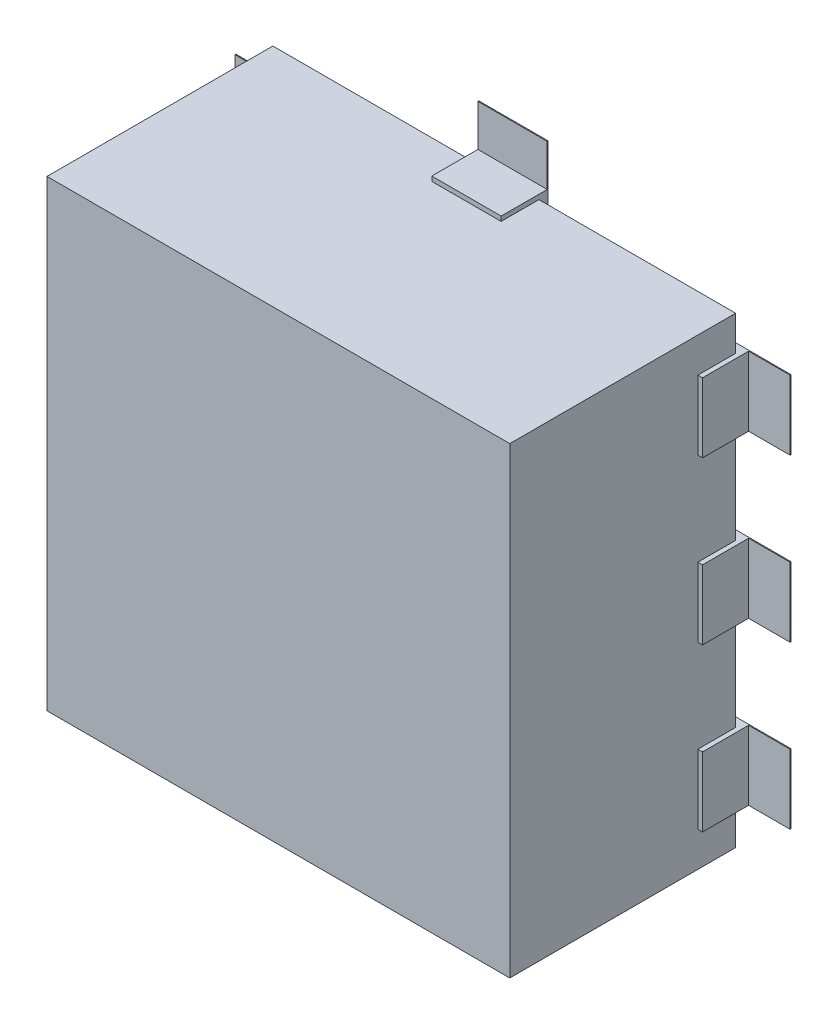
ISO-10303-21;
HEADER;
FILE_DESCRIPTION(('STEP AP214'),'2;1');
FILE_NAME('part.step','',(''),(''),'','','');
FILE_SCHEMA(('AUTOMOTIVE_DESIGN { 1 0 10303 214 1 1 1 1 }'));
ENDSEC;
DATA;
#1=APPLICATION_CONTEXT('core data for automotive mechanical design processes');
#2=APPLICATION_PROTOCOL_DEFINITION('international standard','automotive_design',2000,#1);
#3=PRODUCT_CONTEXT('',#1,'mechanical');
#4=PRODUCT('Part','Part','',(#3));
#5=PRODUCT_RELATED_PRODUCT_CATEGORY('part','',(#4));
#6=PRODUCT_DEFINITION_FORMATION('','',#4);
#7=PRODUCT_DEFINITION_CONTEXT('part definition',#1,'design');
#8=PRODUCT_DEFINITION('design','',#6,#7);
#9=PRODUCT_DEFINITION_SHAPE('','',#8);
#10=(LENGTH_UNIT() NAMED_UNIT(*) SI_UNIT(.MILLI.,.METRE.));
#11=(NAMED_UNIT(*) PLANE_ANGLE_UNIT() SI_UNIT($,.RADIAN.));
#12=(NAMED_UNIT(*) SI_UNIT($,.STERADIAN.) SOLID_ANGLE_UNIT());
#13=UNCERTAINTY_MEASURE_WITH_UNIT(LENGTH_MEASURE(1.E-05),#10,'distance_accuracy_value','');
#14=(GEOMETRIC_REPRESENTATION_CONTEXT(3) GLOBAL_UNCERTAINTY_ASSIGNED_CONTEXT((#13)) GLOBAL_UNIT_ASSIGNED_CONTEXT((#10,
#11,#12)) REPRESENTATION_CONTEXT('',''));
#15=CARTESIAN_POINT('',(0.,0.,0.));
#16=DIRECTION('',(0.,0.,1.));
#17=DIRECTION('',(1.,0.,0.));
#18=AXIS2_PLACEMENT_3D('',#15,#16,#17);
#19=CARTESIAN_POINT('',(0.07493,0.599948,0.0762));
#20=DIRECTION('',(0.,1.,0.));
#21=DIRECTION('',(0.,0.,1.));
#22=AXIS2_PLACEMENT_3D('',#19,#20,#21);
#23=PLANE('',#22);
#24=DIRECTION('',(0.,0.,-1.));
#25=VECTOR('',#24,1.);
#26=CARTESIAN_POINT('',(0.07493,0.599948,0.0762));
#27=LINE('',#26,#25);
#28=CARTESIAN_POINT('',(0.07493,0.599948,0.0762));
#29=VERTEX_POINT('',#28);
#30=CARTESIAN_POINT('',(0.07493,0.599948,0.078199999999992));
#31=VERTEX_POINT('',#30);
#32=EDGE_CURVE('E460',#29,#31,#27,.F.);
#33=ORIENTED_EDGE('',*,*,#32,.F.);
#34=DIRECTION('',(1.,0.,0.));
#35=VECTOR('',#34,1.);
#36=CARTESIAN_POINT('',(0.,0.599948,0.0762));
#37=LINE('',#36,#35);
#38=CARTESIAN_POINT('',(-0.07493,0.599948,0.0762));
#39=VERTEX_POINT('',#38);
#40=EDGE_CURVE('E455',#29,#39,#37,.F.);
#41=ORIENTED_EDGE('',*,*,#40,.T.);
#42=DIRECTION('',(0.,0.,1.));
#43=VECTOR('',#42,1.);
#44=CARTESIAN_POINT('',(-0.07493,0.599948,0.0762));
#45=LINE('',#44,#43);
#46=CARTESIAN_POINT('',(-0.07493,0.599948,0.078199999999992));
#47=VERTEX_POINT('',#46);
#48=EDGE_CURVE('E19',#47,#39,#45,.F.);
#49=ORIENTED_EDGE('',*,*,#48,.F.);
#50=DIRECTION('',(1.,0.,0.));
#51=VECTOR('',#50,1.);
#52=CARTESIAN_POINT('',(0.,0.599948,0.078199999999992));
#53=LINE('',#52,#51);
#54=EDGE_CURVE('E450',#31,#47,#53,.F.);
#55=ORIENTED_EDGE('',*,*,#54,.F.);
#56=EDGE_LOOP('',(#33,#41,#49,#55));
#57=FACE_BOUND('',#56,.T.);
#58=ADVANCED_FACE('F16',(#57),#23,.T.);
#59=CARTESIAN_POINT('',(0.,0.,0.078199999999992));
#60=DIRECTION('',(0.,0.,1.));
#61=DIRECTION('',(1.,0.,0.));
#62=AXIS2_PLACEMENT_3D('',#59,#60,#61);
#63=PLANE('',#62);
#64=DIRECTION('',(0.,1.,0.));
#65=VECTOR('',#64,1.);
#66=CARTESIAN_POINT('',(-0.07493,0.509999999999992,0.078199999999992));
#67=LINE('',#66,#65);
#68=CARTESIAN_POINT('',(-0.07493,0.509999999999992,0.078199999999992));
#69=VERTEX_POINT('',#68);
#70=EDGE_CURVE('E478',#69,#47,#67,.T.);
#71=ORIENTED_EDGE('',*,*,#70,.F.);
#72=DIRECTION('',(1.,0.,0.));
#73=VECTOR('',#72,1.);
#74=CARTESIAN_POINT('',(0.07493,0.509999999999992,0.078199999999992));
#75=LINE('',#74,#73);
#76=CARTESIAN_POINT('',(0.07493,0.509999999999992,0.078199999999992));
#77=VERTEX_POINT('',#76);
#78=EDGE_CURVE('E956',#77,#69,#75,.F.);
#79=ORIENTED_EDGE('',*,*,#78,.F.);
#80=DIRECTION('',(0.,1.,0.));
#81=VECTOR('',#80,1.);
#82=CARTESIAN_POINT('',(0.07493,0.225044,0.078199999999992));
#83=LINE('',#82,#81);
#84=EDGE_CURVE('E1034',#31,#77,#83,.F.);
#85=ORIENTED_EDGE('',*,*,#84,.F.);
#86=ORIENTED_EDGE('',*,*,#54,.T.);
#87=EDGE_LOOP('',(#71,#79,#85,#86));
#88=FACE_BOUND('',#87,.T.);
#89=ADVANCED_FACE('F2104',(#88),#63,.T.);
#90=CARTESIAN_POINT('',(0.07493,0.509999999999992,0.0762));
#91=DIRECTION('',(0.,1.,0.));
#92=DIRECTION('',(0.,0.,1.));
#93=AXIS2_PLACEMENT_3D('',#90,#91,#92);
#94=PLANE('',#93);
#95=DIRECTION('',(0.,0.,-1.));
#96=VECTOR('',#95,1.);
#97=CARTESIAN_POINT('',(0.07493,0.509999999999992,0.0762));
#98=LINE('',#97,#96);
#99=CARTESIAN_POINT('',(0.07493,0.509999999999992,0.1778));
#100=VERTEX_POINT('',#99);
#101=EDGE_CURVE('E1031',#77,#100,#98,.F.);
#102=ORIENTED_EDGE('',*,*,#101,.F.);
#103=ORIENTED_EDGE('',*,*,#78,.T.);
#104=DIRECTION('',(0.,0.,1.));
#105=VECTOR('',#104,1.);
#106=CARTESIAN_POINT('',(-0.07493,0.509999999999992,0.0762));
#107=LINE('',#106,#105);
#108=CARTESIAN_POINT('',(-0.07493,0.509999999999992,0.1778));
#109=VERTEX_POINT('',#108);
#110=EDGE_CURVE('E479',#109,#69,#107,.F.);
#111=ORIENTED_EDGE('',*,*,#110,.F.);
#112=DIRECTION('',(1.,0.,0.));
#113=VECTOR('',#112,1.);
#114=CARTESIAN_POINT('',(0.,0.509999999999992,0.1778));
#115=LINE('',#114,#113);
#116=EDGE_CURVE('E1064',#100,#109,#115,.F.);
#117=ORIENTED_EDGE('',*,*,#116,.F.);
#118=EDGE_LOOP('',(#102,#103,#111,#117));
#119=FACE_BOUND('',#118,.T.);
#120=ADVANCED_FACE('F2095',(#119),#94,.T.);
#121=CARTESIAN_POINT('',(-0.509999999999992,0.07493,0.0762));
#122=DIRECTION('',(-1.,0.,0.));
#123=DIRECTION('',(0.,0.,1.));
#124=AXIS2_PLACEMENT_3D('',#121,#122,#123);
#125=PLANE('',#124);
#126=DIRECTION('',(0.,0.,1.));
#127=VECTOR('',#126,1.);
#128=CARTESIAN_POINT('',(-0.509999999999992,0.07493,0.0762));
#129=LINE('',#128,#127);
#130=CARTESIAN_POINT('',(-0.509999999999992,0.07493,0.078199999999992));
#131=VERTEX_POINT('',#130);
#132=CARTESIAN_POINT('',(-0.509999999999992,0.07493,0.1778));
#133=VERTEX_POINT('',#132);
#134=EDGE_CURVE('E986',#131,#133,#129,.T.);
#135=ORIENTED_EDGE('',*,*,#134,.F.);
#136=DIRECTION('',(0.,1.,0.));
#137=VECTOR('',#136,1.);
#138=CARTESIAN_POINT('',(-0.509999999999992,0.,0.078199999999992));
#139=LINE('',#138,#137);
#140=CARTESIAN_POINT('',(-0.509999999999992,-0.07493,0.078199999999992));
#141=VERTEX_POINT('',#140);
#142=EDGE_CURVE('E954',#141,#131,#139,.T.);
#143=ORIENTED_EDGE('',*,*,#142,.F.);
#144=DIRECTION('',(0.,0.,-1.));
#145=VECTOR('',#144,1.);
#146=CARTESIAN_POINT('',(-0.509999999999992,-0.07493,0.0762));
#147=LINE('',#146,#145);
#148=CARTESIAN_POINT('',(-0.509999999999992,-0.07493,0.1778));
#149=VERTEX_POINT('',#148);
#150=EDGE_CURVE('E959',#149,#141,#147,.T.);
#151=ORIENTED_EDGE('',*,*,#150,.F.);
#152=DIRECTION('',(0.,1.,0.));
#153=VECTOR('',#152,1.);
#154=CARTESIAN_POINT('',(-0.509999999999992,0.,0.1778));
#155=LINE('',#154,#153);
#156=EDGE_CURVE('E774',#133,#149,#155,.F.);
#157=ORIENTED_EDGE('',*,*,#156,.F.);
#158=EDGE_LOOP('',(#135,#143,#151,#157));
#159=FACE_BOUND('',#158,.T.);
#160=ADVANCED_FACE('F2085',(#159),#125,.T.);
#161=CARTESIAN_POINT('',(0.,0.,0.078199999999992));
#162=DIRECTION('',(0.,0.,1.));
#163=DIRECTION('',(1.,0.,0.));
#164=AXIS2_PLACEMENT_3D('',#161,#162,#163);
#165=PLANE('',#164);
#166=DIRECTION('',(1.,0.,0.));
#167=VECTOR('',#166,1.);
#168=CARTESIAN_POINT('',(-0.509999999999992,-0.07493,0.078199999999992));
#169=LINE('',#168,#167);
#170=CARTESIAN_POINT('',(-0.599948,-0.07493,0.078199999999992));
#171=VERTEX_POINT('',#170);
#172=EDGE_CURVE('E962',#141,#171,#169,.F.);
#173=ORIENTED_EDGE('',*,*,#172,.F.);
#174=ORIENTED_EDGE('',*,*,#142,.T.);
#175=DIRECTION('',(1.,0.,0.));
#176=VECTOR('',#175,1.);
#177=CARTESIAN_POINT('',(-0.225044,0.07493,0.078199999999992));
#178=LINE('',#177,#176);
#179=CARTESIAN_POINT('',(-0.599948,0.07493,0.078199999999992));
#180=VERTEX_POINT('',#179);
#181=EDGE_CURVE('E990',#180,#131,#178,.T.);
#182=ORIENTED_EDGE('',*,*,#181,.F.);
#183=DIRECTION('',(0.,1.,0.));
#184=VECTOR('',#183,1.);
#185=CARTESIAN_POINT('',(-0.599948,0.07493,0.078199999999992));
#186=LINE('',#185,#184);
#187=EDGE_CURVE('E887',#171,#180,#186,.T.);
#188=ORIENTED_EDGE('',*,*,#187,.F.);
#189=EDGE_LOOP('',(#173,#174,#182,#188));
#190=FACE_BOUND('',#189,.T.);
#191=ADVANCED_FACE('F1422',(#190),#165,.T.);
#192=CARTESIAN_POINT('',(-0.599948,0.07493,0.0762));
#193=DIRECTION('',(-1.,0.,0.));
#194=DIRECTION('',(0.,0.,1.));
#195=AXIS2_PLACEMENT_3D('',#192,#193,#194);
#196=PLANE('',#195);
#197=DIRECTION('',(0.,0.,1.));
#198=VECTOR('',#197,1.);
#199=CARTESIAN_POINT('',(-0.599948,0.07493,0.0762));
#200=LINE('',#199,#198);
#201=CARTESIAN_POINT('',(-0.599948,0.07493,0.0762));
#202=VERTEX_POINT('',#201);
#203=EDGE_CURVE('E1122',#202,#180,#200,.T.);
#204=ORIENTED_EDGE('',*,*,#203,.F.);
#205=DIRECTION('',(0.,1.,0.));
#206=VECTOR('',#205,1.);
#207=CARTESIAN_POINT('',(-0.599948,0.,0.0762));
#208=LINE('',#207,#206);
#209=CARTESIAN_POINT('',(-0.599948,-0.07493,0.0762));
#210=VERTEX_POINT('',#209);
#211=EDGE_CURVE('E737',#202,#210,#208,.F.);
#212=ORIENTED_EDGE('',*,*,#211,.T.);
#213=DIRECTION('',(0.,0.,-1.));
#214=VECTOR('',#213,1.);
#215=CARTESIAN_POINT('',(-0.599948,-0.07493,0.0762));
#216=LINE('',#215,#214);
#217=EDGE_CURVE('E1119',#171,#210,#216,.T.);
#218=ORIENTED_EDGE('',*,*,#217,.F.);
#219=ORIENTED_EDGE('',*,*,#187,.T.);
#220=EDGE_LOOP('',(#204,#212,#218,#219));
#221=FACE_BOUND('',#220,.T.);
#222=ADVANCED_FACE('F1414',(#221),#196,.T.);
#223=CARTESIAN_POINT('',(-0.509999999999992,-0.275082,0.0762));
#224=DIRECTION('',(-1.,0.,0.));
#225=DIRECTION('',(0.,0.,1.));
#226=AXIS2_PLACEMENT_3D('',#223,#224,#225);
#227=PLANE('',#226);
#228=DIRECTION('',(0.,0.,1.));
#229=VECTOR('',#228,1.);
#230=CARTESIAN_POINT('',(-0.509999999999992,-0.275082,0.0762));
#231=LINE('',#230,#229);
#232=CARTESIAN_POINT('',(-0.509999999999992,-0.275082,0.078199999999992));
#233=VERTEX_POINT('',#232);
#234=CARTESIAN_POINT('',(-0.509999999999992,-0.275082,0.1778));
#235=VERTEX_POINT('',#234);
#236=EDGE_CURVE('E929',#233,#235,#231,.T.);
#237=ORIENTED_EDGE('',*,*,#236,.F.);
#238=DIRECTION('',(0.,1.,0.));
#239=VECTOR('',#238,1.);
#240=CARTESIAN_POINT('',(-0.509999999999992,0.,0.078199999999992));
#241=LINE('',#240,#239);
#242=CARTESIAN_POINT('',(-0.509999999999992,-0.424942,0.078199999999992));
#243=VERTEX_POINT('',#242);
#244=EDGE_CURVE('E885',#243,#233,#241,.T.);
#245=ORIENTED_EDGE('',*,*,#244,.F.);
#246=DIRECTION('',(0.,0.,-1.));
#247=VECTOR('',#246,1.);
#248=CARTESIAN_POINT('',(-0.509999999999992,-0.424942,0.0762));
#249=LINE('',#248,#247);
#250=CARTESIAN_POINT('',(-0.509999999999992,-0.424942,0.1778));
#251=VERTEX_POINT('',#250);
#252=EDGE_CURVE('E890',#251,#243,#249,.T.);
#253=ORIENTED_EDGE('',*,*,#252,.F.);
#254=DIRECTION('',(0.,1.,0.));
#255=VECTOR('',#254,1.);
#256=CARTESIAN_POINT('',(-0.509999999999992,0.,0.1778));
#257=LINE('',#256,#255);
#258=EDGE_CURVE('E881',#235,#251,#257,.F.);
#259=ORIENTED_EDGE('',*,*,#258,.F.);
#260=EDGE_LOOP('',(#237,#245,#253,#259));
#261=FACE_BOUND('',#260,.T.);
#262=ADVANCED_FACE('F1412',(#261),#227,.T.);
#263=CARTESIAN_POINT('',(0.,0.,0.078199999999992));
#264=DIRECTION('',(0.,0.,1.));
#265=DIRECTION('',(1.,0.,0.));
#266=AXIS2_PLACEMENT_3D('',#263,#264,#265);
#267=PLANE('',#266);
#268=DIRECTION('',(1.,0.,0.));
#269=VECTOR('',#268,1.);
#270=CARTESIAN_POINT('',(-0.509999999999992,-0.424942,0.078199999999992));
#271=LINE('',#270,#269);
#272=CARTESIAN_POINT('',(-0.599694,-0.424942,0.078199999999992));
#273=VERTEX_POINT('',#272);
#274=EDGE_CURVE('E893',#243,#273,#271,.F.);
#275=ORIENTED_EDGE('',*,*,#274,.F.);
#276=ORIENTED_EDGE('',*,*,#244,.T.);
#277=DIRECTION('',(1.,0.,0.));
#278=VECTOR('',#277,1.);
#279=CARTESIAN_POINT('',(-0.325374,-0.275082,0.078199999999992));
#280=LINE('',#279,#278);
#281=CARTESIAN_POINT('',(-0.599694,-0.275082,0.078199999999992));
#282=VERTEX_POINT('',#281);
#283=EDGE_CURVE('E933',#282,#233,#280,.T.);
#284=ORIENTED_EDGE('',*,*,#283,.F.);
#285=DIRECTION('',(0.,1.,0.));
#286=VECTOR('',#285,1.);
#287=CARTESIAN_POINT('',(-0.599694,-0.275082,0.078199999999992));
#288=LINE('',#287,#286);
#289=EDGE_CURVE('E876',#273,#282,#288,.T.);
#290=ORIENTED_EDGE('',*,*,#289,.F.);
#291=EDGE_LOOP('',(#275,#276,#284,#290));
#292=FACE_BOUND('',#291,.T.);
#293=ADVANCED_FACE('F1410',(#292),#267,.T.);
#294=CARTESIAN_POINT('',(-0.599694,-0.275082,0.0762));
#295=DIRECTION('',(-1.,0.,0.));
#296=DIRECTION('',(0.,0.,1.));
#297=AXIS2_PLACEMENT_3D('',#294,#295,#296);
#298=PLANE('',#297);
#299=DIRECTION('',(0.,0.,1.));
#300=VECTOR('',#299,1.);
#301=CARTESIAN_POINT('',(-0.599694,-0.275082,0.0762));
#302=LINE('',#301,#300);
#303=CARTESIAN_POINT('',(-0.599694,-0.275082,0.0762));
#304=VERTEX_POINT('',#303);
#305=EDGE_CURVE('E1116',#304,#282,#302,.T.);
#306=ORIENTED_EDGE('',*,*,#305,.F.);
#307=DIRECTION('',(0.,1.,0.));
#308=VECTOR('',#307,1.);
#309=CARTESIAN_POINT('',(-0.599694,0.,0.0762));
#310=LINE('',#309,#308);
#311=CARTESIAN_POINT('',(-0.599694,-0.424942,0.0762));
#312=VERTEX_POINT('',#311);
#313=EDGE_CURVE('E831',#304,#312,#310,.F.);
#314=ORIENTED_EDGE('',*,*,#313,.T.);
#315=DIRECTION('',(0.,0.,-1.));
#316=VECTOR('',#315,1.);
#317=CARTESIAN_POINT('',(-0.599694,-0.424942,0.0762));
#318=LINE('',#317,#316);
#319=EDGE_CURVE('E1113',#273,#312,#318,.T.);
#320=ORIENTED_EDGE('',*,*,#319,.F.);
#321=ORIENTED_EDGE('',*,*,#289,.T.);
#322=EDGE_LOOP('',(#306,#314,#320,#321));
#323=FACE_BOUND('',#322,.T.);
#324=ADVANCED_FACE('F1406',(#323),#298,.T.);
#325=CARTESIAN_POINT('',(0.,0.,0.0762));
#326=DIRECTION('',(0.,0.,1.));
#327=DIRECTION('',(1.,0.,0.));
#328=AXIS2_PLACEMENT_3D('',#325,#326,#327);
#329=PLANE('',#328);
#330=DIRECTION('',(1.,0.,0.));
#331=VECTOR('',#330,1.);
#332=CARTESIAN_POINT('',(-0.509999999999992,-0.424942,0.0762));
#333=LINE('',#332,#331);
#334=CARTESIAN_POINT('',(-0.325374,-0.424942,0.0762));
#335=VERTEX_POINT('',#334);
#336=EDGE_CURVE('E849',#312,#335,#333,.T.);
#337=ORIENTED_EDGE('',*,*,#336,.F.);
#338=ORIENTED_EDGE('',*,*,#313,.F.);
#339=DIRECTION('',(1.,0.,0.));
#340=VECTOR('',#339,1.);
#341=CARTESIAN_POINT('',(-0.325374,-0.275082,0.0762));
#342=LINE('',#341,#340);
#343=CARTESIAN_POINT('',(-0.325374,-0.275082,0.0762));
#344=VERTEX_POINT('',#343);
#345=EDGE_CURVE('E944',#344,#304,#342,.F.);
#346=ORIENTED_EDGE('',*,*,#345,.F.);
#347=DIRECTION('',(0.,1.,0.));
#348=VECTOR('',#347,1.);
#349=CARTESIAN_POINT('',(-0.325374,-0.424942,0.0762));
#350=LINE('',#349,#348);
#351=EDGE_CURVE('E465',#335,#344,#350,.T.);
#352=ORIENTED_EDGE('',*,*,#351,.F.);
#353=EDGE_LOOP('',(#337,#338,#346,#352));
#354=FACE_BOUND('',#353,.T.);
#355=ADVANCED_FACE('F1403',(#354),#329,.F.);
#356=CARTESIAN_POINT('',(-0.07493,0.225044,0.0762));
#357=DIRECTION('',(-0.707106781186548,0.707106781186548,0.));
#358=DIRECTION('',(-0.707106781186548,-0.707106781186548,0.));
#359=AXIS2_PLACEMENT_3D('',#356,#357,#358);
#360=PLANE('',#359);
#361=DIRECTION('',(0.,0.,1.));
#362=VECTOR('',#361,1.);
#363=CARTESIAN_POINT('',(-0.225044,0.07493,0.0762));
#364=LINE('',#363,#362);
#365=CARTESIAN_POINT('',(-0.225044,0.07493,0.0961999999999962));
#366=VERTEX_POINT('',#365);
#367=CARTESIAN_POINT('',(-0.225044,0.07493,0.0762));
#368=VERTEX_POINT('',#367);
#369=EDGE_CURVE('E1001',#366,#368,#364,.F.);
#370=ORIENTED_EDGE('',*,*,#369,.F.);
#371=DIRECTION('',(0.707106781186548,0.707106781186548,0.));
#372=VECTOR('',#371,1.);
#373=CARTESIAN_POINT('',(-0.225044,0.07493,0.0961999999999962));
#374=LINE('',#373,#372);
#375=CARTESIAN_POINT('',(-0.07493,0.225044,0.0961999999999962));
#376=VERTEX_POINT('',#375);
#377=EDGE_CURVE('E1010',#366,#376,#374,.T.);
#378=ORIENTED_EDGE('',*,*,#377,.T.);
#379=DIRECTION('',(0.,0.,1.));
#380=VECTOR('',#379,1.);
#381=CARTESIAN_POINT('',(-0.07493,0.225044,0.0762));
#382=LINE('',#381,#380);
#383=CARTESIAN_POINT('',(-0.07493,0.225044,0.0762));
#384=VERTEX_POINT('',#383);
#385=EDGE_CURVE('E481',#384,#376,#382,.T.);
#386=ORIENTED_EDGE('',*,*,#385,.F.);
#387=DIRECTION('',(-0.707106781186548,-0.707106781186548,0.));
#388=VECTOR('',#387,1.);
#389=CARTESIAN_POINT('',(-0.07493,0.225044,0.0762));
#390=LINE('',#389,#388);
#391=EDGE_CURVE('E464',#384,#368,#390,.T.);
#392=ORIENTED_EDGE('',*,*,#391,.T.);
#393=EDGE_LOOP('',(#370,#378,#386,#392));
#394=FACE_BOUND('',#393,.T.);
#395=ADVANCED_FACE('F1624',(#394),#360,.T.);
#396=CARTESIAN_POINT('',(-0.325374,0.275082,0.0762));
#397=DIRECTION('',(1.,0.,0.));
#398=DIRECTION('',(0.,0.,-1.));
#399=AXIS2_PLACEMENT_3D('',#396,#397,#398);
#400=PLANE('',#399);
#401=DIRECTION('',(0.,0.,1.));
#402=VECTOR('',#401,1.);
#403=CARTESIAN_POINT('',(-0.325374,0.424942,0.0762));
#404=LINE('',#403,#402);
#405=CARTESIAN_POINT('',(-0.325374,0.424942,0.0961999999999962));
#406=VERTEX_POINT('',#405);
#407=CARTESIAN_POINT('',(-0.325374,0.424942,0.0762));
#408=VERTEX_POINT('',#407);
#409=EDGE_CURVE('E834',#406,#408,#404,.F.);
#410=ORIENTED_EDGE('',*,*,#409,.F.);
#411=DIRECTION('',(0.,1.,0.));
#412=VECTOR('',#411,1.);
#413=CARTESIAN_POINT('',(-0.325374,0.,0.0961999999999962));
#414=LINE('',#413,#412);
#415=CARTESIAN_POINT('',(-0.325374,0.275082,0.0961999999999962));
#416=VERTEX_POINT('',#415);
#417=EDGE_CURVE('E846',#406,#416,#414,.F.);
#418=ORIENTED_EDGE('',*,*,#417,.T.);
#419=DIRECTION('',(0.,0.,-1.));
#420=VECTOR('',#419,1.);
#421=CARTESIAN_POINT('',(-0.325374,0.275082,0.0762));
#422=LINE('',#421,#420);
#423=CARTESIAN_POINT('',(-0.325374,0.275082,0.0762));
#424=VERTEX_POINT('',#423);
#425=EDGE_CURVE('E864',#424,#416,#422,.F.);
#426=ORIENTED_EDGE('',*,*,#425,.F.);
#427=DIRECTION('',(0.,1.,0.));
#428=VECTOR('',#427,1.);
#429=CARTESIAN_POINT('',(-0.325374,0.,0.0762));
#430=LINE('',#429,#428);
#431=EDGE_CURVE('E829',#424,#408,#430,.T.);
#432=ORIENTED_EDGE('',*,*,#431,.T.);
#433=EDGE_LOOP('',(#410,#418,#426,#432));
#434=FACE_BOUND('',#433,.T.);
#435=ADVANCED_FACE('F1620',(#434),#400,.T.);
#436=CARTESIAN_POINT('',(0.,0.,0.0762));
#437=DIRECTION('',(0.,0.,1.));
#438=DIRECTION('',(1.,0.,0.));
#439=AXIS2_PLACEMENT_3D('',#436,#437,#438);
#440=PLANE('',#439);
#441=DIRECTION('',(1.,0.,0.));
#442=VECTOR('',#441,1.);
#443=CARTESIAN_POINT('',(-0.509999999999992,0.275082,0.0762));
#444=LINE('',#443,#442);
#445=CARTESIAN_POINT('',(-0.599694,0.275082,0.0762));
#446=VERTEX_POINT('',#445);
#447=EDGE_CURVE('E1005',#446,#424,#444,.T.);
#448=ORIENTED_EDGE('',*,*,#447,.F.);
#449=DIRECTION('',(0.,1.,0.));
#450=VECTOR('',#449,1.);
#451=CARTESIAN_POINT('',(-0.599694,0.424942,0.0762));
#452=LINE('',#451,#450);
#453=CARTESIAN_POINT('',(-0.599694,0.424942,0.0762));
#454=VERTEX_POINT('',#453);
#455=EDGE_CURVE('E818',#454,#446,#452,.F.);
#456=ORIENTED_EDGE('',*,*,#455,.F.);
#457=DIRECTION('',(1.,0.,0.));
#458=VECTOR('',#457,1.);
#459=CARTESIAN_POINT('',(-0.325374,0.424942,0.0762));
#460=LINE('',#459,#458);
#461=EDGE_CURVE('E837',#408,#454,#460,.F.);
#462=ORIENTED_EDGE('',*,*,#461,.F.);
#463=ORIENTED_EDGE('',*,*,#431,.F.);
#464=EDGE_LOOP('',(#448,#456,#462,#463));
#465=FACE_BOUND('',#464,.T.);
#466=ADVANCED_FACE('F1616',(#465),#440,.F.);
#467=CARTESIAN_POINT('',(-0.599694,0.424942,0.0762));
#468=DIRECTION('',(-1.,0.,0.));
#469=DIRECTION('',(0.,0.,1.));
#470=AXIS2_PLACEMENT_3D('',#467,#468,#469);
#471=PLANE('',#470);
#472=DIRECTION('',(0.,0.,1.));
#473=VECTOR('',#472,1.);
#474=CARTESIAN_POINT('',(-0.599694,0.424942,0.0762));
#475=LINE('',#474,#473);
#476=CARTESIAN_POINT('',(-0.599694,0.424942,0.078199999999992));
#477=VERTEX_POINT('',#476);
#478=EDGE_CURVE('E1110',#454,#477,#475,.T.);
#479=ORIENTED_EDGE('',*,*,#478,.F.);
#480=ORIENTED_EDGE('',*,*,#455,.T.);
#481=DIRECTION('',(0.,0.,-1.));
#482=VECTOR('',#481,1.);
#483=CARTESIAN_POINT('',(-0.599694,0.275082,0.0762));
#484=LINE('',#483,#482);
#485=CARTESIAN_POINT('',(-0.599694,0.275082,0.078199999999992));
#486=VERTEX_POINT('',#485);
#487=EDGE_CURVE('E1125',#486,#446,#484,.T.);
#488=ORIENTED_EDGE('',*,*,#487,.F.);
#489=DIRECTION('',(0.,1.,0.));
#490=VECTOR('',#489,1.);
#491=CARTESIAN_POINT('',(-0.599694,0.,0.078199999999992));
#492=LINE('',#491,#490);
#493=EDGE_CURVE('E815',#477,#486,#492,.F.);
#494=ORIENTED_EDGE('',*,*,#493,.F.);
#495=EDGE_LOOP('',(#479,#480,#488,#494));
#496=FACE_BOUND('',#495,.T.);
#497=ADVANCED_FACE('F1612',(#496),#471,.T.);
#498=CARTESIAN_POINT('',(0.,0.,0.078199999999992));
#499=DIRECTION('',(0.,0.,1.));
#500=DIRECTION('',(1.,0.,0.));
#501=AXIS2_PLACEMENT_3D('',#498,#499,#500);
#502=PLANE('',#501);
#503=DIRECTION('',(1.,0.,0.));
#504=VECTOR('',#503,1.);
#505=CARTESIAN_POINT('',(-0.509999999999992,0.275082,0.078199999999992));
#506=LINE('',#505,#504);
#507=CARTESIAN_POINT('',(-0.509999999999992,0.275082,0.078199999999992));
#508=VERTEX_POINT('',#507);
#509=EDGE_CURVE('E1018',#508,#486,#506,.F.);
#510=ORIENTED_EDGE('',*,*,#509,.F.);
#511=DIRECTION('',(0.,1.,0.));
#512=VECTOR('',#511,1.);
#513=CARTESIAN_POINT('',(-0.509999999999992,0.424942,0.078199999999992));
#514=LINE('',#513,#512);
#515=CARTESIAN_POINT('',(-0.509999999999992,0.424942,0.078199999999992));
#516=VERTEX_POINT('',#515);
#517=EDGE_CURVE('E817',#516,#508,#514,.F.);
#518=ORIENTED_EDGE('',*,*,#517,.F.);
#519=DIRECTION('',(1.,0.,0.));
#520=VECTOR('',#519,1.);
#521=CARTESIAN_POINT('',(-0.325374,0.424942,0.078199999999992));
#522=LINE('',#521,#520);
#523=EDGE_CURVE('E822',#477,#516,#522,.T.);
#524=ORIENTED_EDGE('',*,*,#523,.F.);
#525=ORIENTED_EDGE('',*,*,#493,.T.);
#526=EDGE_LOOP('',(#510,#518,#524,#525));
#527=FACE_BOUND('',#526,.T.);
#528=ADVANCED_FACE('F1608',(#527),#502,.T.);
#529=CARTESIAN_POINT('',(-0.509999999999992,0.424942,0.0762));
#530=DIRECTION('',(-1.,0.,0.));
#531=DIRECTION('',(0.,0.,1.));
#532=AXIS2_PLACEMENT_3D('',#529,#530,#531);
#533=PLANE('',#532);
#534=DIRECTION('',(0.,0.,1.));
#535=VECTOR('',#534,1.);
#536=CARTESIAN_POINT('',(-0.509999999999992,0.424942,0.0762));
#537=LINE('',#536,#535);
#538=CARTESIAN_POINT('',(-0.509999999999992,0.424942,0.1778));
#539=VERTEX_POINT('',#538);
#540=EDGE_CURVE('E819',#516,#539,#537,.T.);
#541=ORIENTED_EDGE('',*,*,#540,.F.);
#542=ORIENTED_EDGE('',*,*,#517,.T.);
#543=DIRECTION('',(0.,0.,-1.));
#544=VECTOR('',#543,1.);
#545=CARTESIAN_POINT('',(-0.509999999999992,0.275082,0.0762));
#546=LINE('',#545,#544);
#547=CARTESIAN_POINT('',(-0.509999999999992,0.275082,0.1778));
#548=VERTEX_POINT('',#547);
#549=EDGE_CURVE('E867',#548,#508,#546,.T.);
#550=ORIENTED_EDGE('',*,*,#549,.F.);
#551=DIRECTION('',(0.,1.,0.));
#552=VECTOR('',#551,1.);
#553=CARTESIAN_POINT('',(-0.509999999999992,0.,0.1778));
#554=LINE('',#553,#552);
#555=EDGE_CURVE('E1023',#539,#548,#554,.F.);
#556=ORIENTED_EDGE('',*,*,#555,.F.);
#557=EDGE_LOOP('',(#541,#542,#550,#556));
#558=FACE_BOUND('',#557,.T.);
#559=ADVANCED_FACE('F1605',(#558),#533,.T.);
#560=CARTESIAN_POINT('',(-0.325374,-0.424942,0.0762));
#561=DIRECTION('',(1.,0.,0.));
#562=DIRECTION('',(0.,0.,-1.));
#563=AXIS2_PLACEMENT_3D('',#560,#561,#562);
#564=PLANE('',#563);
#565=DIRECTION('',(0.,0.,1.));
#566=VECTOR('',#565,1.);
#567=CARTESIAN_POINT('',(-0.325374,-0.275082,0.0762));
#568=LINE('',#567,#566);
#569=CARTESIAN_POINT('',(-0.325374,-0.275082,0.0961999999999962));
#570=VERTEX_POINT('',#569);
#571=EDGE_CURVE('E941',#570,#344,#568,.F.);
#572=ORIENTED_EDGE('',*,*,#571,.F.);
#573=DIRECTION('',(0.,1.,0.));
#574=VECTOR('',#573,1.);
#575=CARTESIAN_POINT('',(-0.325374,0.,0.0961999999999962));
#576=LINE('',#575,#574);
#577=CARTESIAN_POINT('',(-0.325374,-0.424942,0.0961999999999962));
#578=VERTEX_POINT('',#577);
#579=EDGE_CURVE('E919',#570,#578,#576,.F.);
#580=ORIENTED_EDGE('',*,*,#579,.T.);
#581=DIRECTION('',(0.,0.,-1.));
#582=VECTOR('',#581,1.);
#583=CARTESIAN_POINT('',(-0.325374,-0.424942,0.0762));
#584=LINE('',#583,#582);
#585=EDGE_CURVE('E877',#335,#578,#584,.F.);
#586=ORIENTED_EDGE('',*,*,#585,.F.);
#587=ORIENTED_EDGE('',*,*,#351,.T.);
#588=EDGE_LOOP('',(#572,#580,#586,#587));
#589=FACE_BOUND('',#588,.T.);
#590=ADVANCED_FACE('F1398',(#589),#564,.T.);
#591=CARTESIAN_POINT('',(-0.225044,-0.07493,0.0762));
#592=DIRECTION('',(-0.707106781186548,-0.707106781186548,0.));
#593=DIRECTION('',(0.707106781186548,-0.707106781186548,0.));
#594=AXIS2_PLACEMENT_3D('',#591,#592,#593);
#595=PLANE('',#594);
#596=DIRECTION('',(0.,0.,1.));
#597=VECTOR('',#596,1.);
#598=CARTESIAN_POINT('',(-0.07493,-0.225044,0.0762));
#599=LINE('',#598,#597);
#600=CARTESIAN_POINT('',(-0.07493,-0.225044,0.0961999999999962));
#601=VERTEX_POINT('',#600);
#602=CARTESIAN_POINT('',(-0.07493,-0.225044,0.0762));
#603=VERTEX_POINT('',#602);
#604=EDGE_CURVE('E740',#601,#603,#599,.F.);
#605=ORIENTED_EDGE('',*,*,#604,.F.);
#606=DIRECTION('',(-0.707106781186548,0.707106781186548,0.));
#607=VECTOR('',#606,1.);
#608=CARTESIAN_POINT('',(-0.07493,-0.225044,0.0961999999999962));
#609=LINE('',#608,#607);
#610=CARTESIAN_POINT('',(-0.225044,-0.07493,0.0961999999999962));
#611=VERTEX_POINT('',#610);
#612=EDGE_CURVE('E752',#601,#611,#609,.T.);
#613=ORIENTED_EDGE('',*,*,#612,.T.);
#614=DIRECTION('',(0.,0.,-1.));
#615=VECTOR('',#614,1.);
#616=CARTESIAN_POINT('',(-0.225044,-0.07493,0.0762));
#617=LINE('',#616,#615);
#618=CARTESIAN_POINT('',(-0.225044,-0.07493,0.0762));
#619=VERTEX_POINT('',#618);
#620=EDGE_CURVE('E770',#619,#611,#617,.F.);
#621=ORIENTED_EDGE('',*,*,#620,.F.);
#622=DIRECTION('',(0.707106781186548,-0.707106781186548,0.));
#623=VECTOR('',#622,1.);
#624=CARTESIAN_POINT('',(-0.225044,-0.07493,0.0762));
#625=LINE('',#624,#623);
#626=EDGE_CURVE('E735',#619,#603,#625,.T.);
#627=ORIENTED_EDGE('',*,*,#626,.T.);
#628=EDGE_LOOP('',(#605,#613,#621,#627));
#629=FACE_BOUND('',#628,.T.);
#630=ADVANCED_FACE('F1599',(#629),#595,.T.);
#631=CARTESIAN_POINT('',(0.,0.,0.0762));
#632=DIRECTION('',(0.,0.,1.));
#633=DIRECTION('',(1.,0.,0.));
#634=AXIS2_PLACEMENT_3D('',#631,#632,#633);
#635=PLANE('',#634);
#636=DIRECTION('',(0.,1.,0.));
#637=VECTOR('',#636,1.);
#638=CARTESIAN_POINT('',(0.124968,-0.225044,0.0762));
#639=LINE('',#638,#637);
#640=CARTESIAN_POINT('',(0.124968,-0.225044,0.0762));
#641=VERTEX_POINT('',#640);
#642=CARTESIAN_POINT('',(0.124968,0.225044,0.0762));
#643=VERTEX_POINT('',#642);
#644=EDGE_CURVE('E1046',#641,#643,#639,.T.);
#645=ORIENTED_EDGE('',*,*,#644,.F.);
#646=DIRECTION('',(1.,0.,0.));
#647=VECTOR('',#646,1.);
#648=CARTESIAN_POINT('',(0.07493,-0.225044,0.0762));
#649=LINE('',#648,#647);
#650=CARTESIAN_POINT('',(0.07493,-0.225044,0.0762));
#651=VERTEX_POINT('',#650);
#652=EDGE_CURVE('E801',#651,#641,#649,.T.);
#653=ORIENTED_EDGE('',*,*,#652,.F.);
#654=DIRECTION('',(0.,1.,0.));
#655=VECTOR('',#654,1.);
#656=CARTESIAN_POINT('',(0.07493,-0.509999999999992,0.0762));
#657=LINE('',#656,#655);
#658=CARTESIAN_POINT('',(0.07493,-0.599948,0.0762));
#659=VERTEX_POINT('',#658);
#660=EDGE_CURVE('E921',#659,#651,#657,.T.);
#661=ORIENTED_EDGE('',*,*,#660,.F.);
#662=DIRECTION('',(1.,0.,0.));
#663=VECTOR('',#662,1.);
#664=CARTESIAN_POINT('',(-0.07493,-0.599948,0.0762));
#665=LINE('',#664,#663);
#666=CARTESIAN_POINT('',(-0.07493,-0.599948,0.0762));
#667=VERTEX_POINT('',#666);
#668=EDGE_CURVE('E724',#667,#659,#665,.T.);
#669=ORIENTED_EDGE('',*,*,#668,.F.);
#670=DIRECTION('',(0.,1.,0.));
#671=VECTOR('',#670,1.);
#672=CARTESIAN_POINT('',(-0.07493,-0.225044,0.0762));
#673=LINE('',#672,#671);
#674=EDGE_CURVE('E743',#603,#667,#673,.F.);
#675=ORIENTED_EDGE('',*,*,#674,.F.);
#676=ORIENTED_EDGE('',*,*,#626,.F.);
#677=DIRECTION('',(1.,0.,0.));
#678=VECTOR('',#677,1.);
#679=CARTESIAN_POINT('',(-0.509999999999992,-0.07493,0.0762));
#680=LINE('',#679,#678);
#681=EDGE_CURVE('E945',#210,#619,#680,.T.);
#682=ORIENTED_EDGE('',*,*,#681,.F.);
#683=ORIENTED_EDGE('',*,*,#211,.F.);
#684=DIRECTION('',(1.,0.,0.));
#685=VECTOR('',#684,1.);
#686=CARTESIAN_POINT('',(-0.225044,0.07493,0.0762));
#687=LINE('',#686,#685);
#688=EDGE_CURVE('E1004',#368,#202,#687,.F.);
#689=ORIENTED_EDGE('',*,*,#688,.F.);
#690=ORIENTED_EDGE('',*,*,#391,.F.);
#691=DIRECTION('',(0.,1.,0.));
#692=VECTOR('',#691,1.);
#693=CARTESIAN_POINT('',(-0.07493,0.509999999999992,0.0762));
#694=LINE('',#693,#692);
#695=EDGE_CURVE('E469',#39,#384,#694,.F.);
#696=ORIENTED_EDGE('',*,*,#695,.F.);
#697=ORIENTED_EDGE('',*,*,#40,.F.);
#698=DIRECTION('',(0.,1.,0.));
#699=VECTOR('',#698,1.);
#700=CARTESIAN_POINT('',(0.07493,0.225044,0.0762));
#701=LINE('',#700,#699);
#702=CARTESIAN_POINT('',(0.07493,0.225044,0.0762));
#703=VERTEX_POINT('',#702);
#704=EDGE_CURVE('E1042',#703,#29,#701,.T.);
#705=ORIENTED_EDGE('',*,*,#704,.F.);
#706=DIRECTION('',(1.,0.,0.));
#707=VECTOR('',#706,1.);
#708=CARTESIAN_POINT('',(0.124968,0.225044,0.0762));
#709=LINE('',#708,#707);
#710=EDGE_CURVE('E591',#643,#703,#709,.F.);
#711=ORIENTED_EDGE('',*,*,#710,.F.);
#712=EDGE_LOOP('',(#645,#653,#661,#669,#675,#676,#682,#683,#689,#690,#696,#697,#705,#711));
#713=FACE_BOUND('',#712,.T.);
#714=ADVANCED_FACE('F470',(#713),#635,.F.);
#715=CARTESIAN_POINT('',(-0.07493,-0.599948,0.0762));
#716=DIRECTION('',(0.,-1.,0.));
#717=DIRECTION('',(0.,0.,-1.));
#718=AXIS2_PLACEMENT_3D('',#715,#716,#717);
#719=PLANE('',#718);
#720=DIRECTION('',(0.,0.,1.));
#721=VECTOR('',#720,1.);
#722=CARTESIAN_POINT('',(-0.07493,-0.599948,0.0762));
#723=LINE('',#722,#721);
#724=CARTESIAN_POINT('',(-0.07493,-0.599948,0.078199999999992));
#725=VERTEX_POINT('',#724);
#726=EDGE_CURVE('E1104',#667,#725,#723,.T.);
#727=ORIENTED_EDGE('',*,*,#726,.F.);
#728=ORIENTED_EDGE('',*,*,#668,.T.);
#729=DIRECTION('',(0.,0.,-1.));
#730=VECTOR('',#729,1.);
#731=CARTESIAN_POINT('',(0.07493,-0.599948,0.0762));
#732=LINE('',#731,#730);
#733=CARTESIAN_POINT('',(0.07493,-0.599948,0.078199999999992));
#734=VERTEX_POINT('',#733);
#735=EDGE_CURVE('E1107',#734,#659,#732,.T.);
#736=ORIENTED_EDGE('',*,*,#735,.F.);
#737=DIRECTION('',(1.,0.,0.));
#738=VECTOR('',#737,1.);
#739=CARTESIAN_POINT('',(0.,-0.599948,0.078199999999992));
#740=LINE('',#739,#738);
#741=EDGE_CURVE('E722',#725,#734,#740,.T.);
#742=ORIENTED_EDGE('',*,*,#741,.F.);
#743=EDGE_LOOP('',(#727,#728,#736,#742));
#744=FACE_BOUND('',#743,.T.);
#745=ADVANCED_FACE('F1592',(#744),#719,.T.);
#746=CARTESIAN_POINT('',(0.,0.,0.078199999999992));
#747=DIRECTION('',(0.,0.,1.));
#748=DIRECTION('',(1.,0.,0.));
#749=AXIS2_PLACEMENT_3D('',#746,#747,#748);
#750=PLANE('',#749);
#751=DIRECTION('',(0.,1.,0.));
#752=VECTOR('',#751,1.);
#753=CARTESIAN_POINT('',(0.07493,-0.509999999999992,0.078199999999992));
#754=LINE('',#753,#752);
#755=CARTESIAN_POINT('',(0.07493,-0.509999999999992,0.078199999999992));
#756=VERTEX_POINT('',#755);
#757=EDGE_CURVE('E789',#756,#734,#754,.F.);
#758=ORIENTED_EDGE('',*,*,#757,.F.);
#759=DIRECTION('',(1.,0.,0.));
#760=VECTOR('',#759,1.);
#761=CARTESIAN_POINT('',(-0.07493,-0.509999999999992,0.078199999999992));
#762=LINE('',#761,#760);
#763=CARTESIAN_POINT('',(-0.07493,-0.509999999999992,0.078199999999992));
#764=VERTEX_POINT('',#763);
#765=EDGE_CURVE('E642',#764,#756,#762,.T.);
#766=ORIENTED_EDGE('',*,*,#765,.F.);
#767=DIRECTION('',(0.,1.,0.));
#768=VECTOR('',#767,1.);
#769=CARTESIAN_POINT('',(-0.07493,-0.225044,0.078199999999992));
#770=LINE('',#769,#768);
#771=EDGE_CURVE('E728',#725,#764,#770,.T.);
#772=ORIENTED_EDGE('',*,*,#771,.F.);
#773=ORIENTED_EDGE('',*,*,#741,.T.);
#774=EDGE_LOOP('',(#758,#766,#772,#773));
#775=FACE_BOUND('',#774,.T.);
#776=ADVANCED_FACE('F1588',(#775),#750,.T.);
#777=CARTESIAN_POINT('',(-0.07493,-0.509999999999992,0.0762));
#778=DIRECTION('',(0.,-1.,0.));
#779=DIRECTION('',(0.,0.,-1.));
#780=AXIS2_PLACEMENT_3D('',#777,#778,#779);
#781=PLANE('',#780);
#782=DIRECTION('',(0.,0.,1.));
#783=VECTOR('',#782,1.);
#784=CARTESIAN_POINT('',(-0.07493,-0.509999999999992,0.0762));
#785=LINE('',#784,#783);
#786=CARTESIAN_POINT('',(-0.07493,-0.509999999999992,0.1778));
#787=VERTEX_POINT('',#786);
#788=EDGE_CURVE('E725',#764,#787,#785,.T.);
#789=ORIENTED_EDGE('',*,*,#788,.F.);
#790=ORIENTED_EDGE('',*,*,#765,.T.);
#791=DIRECTION('',(0.,0.,-1.));
#792=VECTOR('',#791,1.);
#793=CARTESIAN_POINT('',(0.07493,-0.509999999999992,0.0762));
#794=LINE('',#793,#792);
#795=CARTESIAN_POINT('',(0.07493,-0.509999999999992,0.1778));
#796=VERTEX_POINT('',#795);
#797=EDGE_CURVE('E783',#796,#756,#794,.T.);
#798=ORIENTED_EDGE('',*,*,#797,.F.);
#799=DIRECTION('',(1.,0.,0.));
#800=VECTOR('',#799,1.);
#801=CARTESIAN_POINT('',(0.,-0.509999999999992,0.1778));
#802=LINE('',#801,#800);
#803=EDGE_CURVE('E794',#787,#796,#802,.T.);
#804=ORIENTED_EDGE('',*,*,#803,.F.);
#805=EDGE_LOOP('',(#789,#790,#798,#804));
#806=FACE_BOUND('',#805,.T.);
#807=ADVANCED_FACE('F1584',(#806),#781,.T.);
#808=CARTESIAN_POINT('',(0.509999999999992,-0.07493,0.0762));
#809=DIRECTION('',(1.,0.,0.));
#810=DIRECTION('',(0.,0.,-1.));
#811=AXIS2_PLACEMENT_3D('',#808,#809,#810);
#812=PLANE('',#811);
#813=DIRECTION('',(0.,0.,-1.));
#814=VECTOR('',#813,1.);
#815=CARTESIAN_POINT('',(0.509999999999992,-0.07493,0.0762));
#816=LINE('',#815,#814);
#817=CARTESIAN_POINT('',(0.509999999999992,-0.07493,0.078199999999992));
#818=VERTEX_POINT('',#817);
#819=CARTESIAN_POINT('',(0.509999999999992,-0.07493,0.1778));
#820=VERTEX_POINT('',#819);
#821=EDGE_CURVE('E683',#818,#820,#816,.F.);
#822=ORIENTED_EDGE('',*,*,#821,.F.);
#823=DIRECTION('',(0.,1.,0.));
#824=VECTOR('',#823,1.);
#825=CARTESIAN_POINT('',(0.509999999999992,0.,0.078199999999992));
#826=LINE('',#825,#824);
#827=CARTESIAN_POINT('',(0.509999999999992,0.07493,0.078199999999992));
#828=VERTEX_POINT('',#827);
#829=EDGE_CURVE('E640',#828,#818,#826,.F.);
#830=ORIENTED_EDGE('',*,*,#829,.F.);
#831=DIRECTION('',(0.,0.,1.));
#832=VECTOR('',#831,1.);
#833=CARTESIAN_POINT('',(0.509999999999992,0.07493,0.0762));
#834=LINE('',#833,#832);
#835=CARTESIAN_POINT('',(0.509999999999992,0.07493,0.1778));
#836=VERTEX_POINT('',#835);
#837=EDGE_CURVE('E645',#836,#828,#834,.F.);
#838=ORIENTED_EDGE('',*,*,#837,.F.);
#839=DIRECTION('',(0.,1.,0.));
#840=VECTOR('',#839,1.);
#841=CARTESIAN_POINT('',(0.509999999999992,0.,0.1778));
#842=LINE('',#841,#840);
#843=EDGE_CURVE('E636',#820,#836,#842,.T.);
#844=ORIENTED_EDGE('',*,*,#843,.F.);
#845=EDGE_LOOP('',(#822,#830,#838,#844));
#846=FACE_BOUND('',#845,.T.);
#847=ADVANCED_FACE('F1580',(#846),#812,.T.);
#848=CARTESIAN_POINT('',(0.,0.,0.078199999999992));
#849=DIRECTION('',(0.,0.,1.));
#850=DIRECTION('',(1.,0.,0.));
#851=AXIS2_PLACEMENT_3D('',#848,#849,#850);
#852=PLANE('',#851);
#853=DIRECTION('',(1.,0.,0.));
#854=VECTOR('',#853,1.);
#855=CARTESIAN_POINT('',(0.509999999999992,0.07493,0.078199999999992));
#856=LINE('',#855,#854);
#857=CARTESIAN_POINT('',(0.599694,0.07493,0.078199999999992));
#858=VERTEX_POINT('',#857);
#859=EDGE_CURVE('E648',#828,#858,#856,.T.);
#860=ORIENTED_EDGE('',*,*,#859,.F.);
#861=ORIENTED_EDGE('',*,*,#829,.T.);
#862=DIRECTION('',(1.,0.,0.));
#863=VECTOR('',#862,1.);
#864=CARTESIAN_POINT('',(0.325374,-0.07493,0.078199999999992));
#865=LINE('',#864,#863);
#866=CARTESIAN_POINT('',(0.599694,-0.07493,0.078199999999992));
#867=VERTEX_POINT('',#866);
#868=EDGE_CURVE('E687',#867,#818,#865,.F.);
#869=ORIENTED_EDGE('',*,*,#868,.F.);
#870=DIRECTION('',(0.,1.,0.));
#871=VECTOR('',#870,1.);
#872=CARTESIAN_POINT('',(0.599694,-0.07493,0.078199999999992));
#873=LINE('',#872,#871);
#874=EDGE_CURVE('E631',#858,#867,#873,.F.);
#875=ORIENTED_EDGE('',*,*,#874,.F.);
#876=EDGE_LOOP('',(#860,#861,#869,#875));
#877=FACE_BOUND('',#876,.T.);
#878=ADVANCED_FACE('F1576',(#877),#852,.T.);
#879=CARTESIAN_POINT('',(0.599694,-0.07493,0.0762));
#880=DIRECTION('',(1.,0.,0.));
#881=DIRECTION('',(0.,0.,-1.));
#882=AXIS2_PLACEMENT_3D('',#879,#880,#881);
#883=PLANE('',#882);
#884=DIRECTION('',(0.,0.,-1.));
#885=VECTOR('',#884,1.);
#886=CARTESIAN_POINT('',(0.599694,-0.07493,0.0762));
#887=LINE('',#886,#885);
#888=CARTESIAN_POINT('',(0.599694,-0.07493,0.0762));
#889=VERTEX_POINT('',#888);
#890=EDGE_CURVE('E1098',#889,#867,#887,.F.);
#891=ORIENTED_EDGE('',*,*,#890,.F.);
#892=DIRECTION('',(0.,1.,0.));
#893=VECTOR('',#892,1.);
#894=CARTESIAN_POINT('',(0.599694,0.,0.0762));
#895=LINE('',#894,#893);
#896=CARTESIAN_POINT('',(0.599694,0.07493,0.0762));
#897=VERTEX_POINT('',#896);
#898=EDGE_CURVE('E561',#889,#897,#895,.T.);
#899=ORIENTED_EDGE('',*,*,#898,.T.);
#900=DIRECTION('',(0.,0.,1.));
#901=VECTOR('',#900,1.);
#902=CARTESIAN_POINT('',(0.599694,0.07493,0.0762));
#903=LINE('',#902,#901);
#904=EDGE_CURVE('E1095',#858,#897,#903,.F.);
#905=ORIENTED_EDGE('',*,*,#904,.F.);
#906=ORIENTED_EDGE('',*,*,#874,.T.);
#907=EDGE_LOOP('',(#891,#899,#905,#906));
#908=FACE_BOUND('',#907,.T.);
#909=ADVANCED_FACE('F1572',(#908),#883,.T.);
#910=CARTESIAN_POINT('',(0.,0.,0.0762));
#911=DIRECTION('',(0.,0.,1.));
#912=DIRECTION('',(1.,0.,0.));
#913=AXIS2_PLACEMENT_3D('',#910,#911,#912);
#914=PLANE('',#913);
#915=DIRECTION('',(1.,0.,0.));
#916=VECTOR('',#915,1.);
#917=CARTESIAN_POINT('',(0.509999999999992,0.07493,0.0762));
#918=LINE('',#917,#916);
#919=CARTESIAN_POINT('',(0.325374,0.07493,0.0762));
#920=VERTEX_POINT('',#919);
#921=EDGE_CURVE('E622',#897,#920,#918,.F.);
#922=ORIENTED_EDGE('',*,*,#921,.F.);
#923=ORIENTED_EDGE('',*,*,#898,.F.);
#924=DIRECTION('',(1.,0.,0.));
#925=VECTOR('',#924,1.);
#926=CARTESIAN_POINT('',(0.325374,-0.07493,0.0762));
#927=LINE('',#926,#925);
#928=CARTESIAN_POINT('',(0.325374,-0.07493,0.0762));
#929=VERTEX_POINT('',#928);
#930=EDGE_CURVE('E698',#929,#889,#927,.T.);
#931=ORIENTED_EDGE('',*,*,#930,.F.);
#932=DIRECTION('',(0.,1.,0.));
#933=VECTOR('',#932,1.);
#934=CARTESIAN_POINT('',(0.325374,0.07493,0.0762));
#935=LINE('',#934,#933);
#936=EDGE_CURVE('E504',#920,#929,#935,.F.);
#937=ORIENTED_EDGE('',*,*,#936,.F.);
#938=EDGE_LOOP('',(#922,#923,#931,#937));
#939=FACE_BOUND('',#938,.T.);
#940=ADVANCED_FACE('F1568',(#939),#914,.F.);
#941=CARTESIAN_POINT('',(0.509999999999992,0.275082,0.0762));
#942=DIRECTION('',(1.,0.,0.));
#943=DIRECTION('',(0.,0.,-1.));
#944=AXIS2_PLACEMENT_3D('',#941,#942,#943);
#945=PLANE('',#944);
#946=DIRECTION('',(0.,0.,-1.));
#947=VECTOR('',#946,1.);
#948=CARTESIAN_POINT('',(0.509999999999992,0.275082,0.0762));
#949=LINE('',#948,#947);
#950=CARTESIAN_POINT('',(0.509999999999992,0.275082,0.078199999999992));
#951=VERTEX_POINT('',#950);
#952=CARTESIAN_POINT('',(0.509999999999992,0.275082,0.1778));
#953=VERTEX_POINT('',#952);
#954=EDGE_CURVE('E606',#951,#953,#949,.F.);
#955=ORIENTED_EDGE('',*,*,#954,.F.);
#956=DIRECTION('',(0.,1.,0.));
#957=VECTOR('',#956,1.);
#958=CARTESIAN_POINT('',(0.509999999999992,0.,0.078199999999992));
#959=LINE('',#958,#957);
#960=CARTESIAN_POINT('',(0.509999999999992,0.424942,0.078199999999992));
#961=VERTEX_POINT('',#960);
#962=EDGE_CURVE('E559',#961,#951,#959,.F.);
#963=ORIENTED_EDGE('',*,*,#962,.F.);
#964=DIRECTION('',(0.,0.,1.));
#965=VECTOR('',#964,1.);
#966=CARTESIAN_POINT('',(0.509999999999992,0.424942,0.0762));
#967=LINE('',#966,#965);
#968=CARTESIAN_POINT('',(0.509999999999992,0.424942,0.1778));
#969=VERTEX_POINT('',#968);
#970=EDGE_CURVE('E564',#969,#961,#967,.F.);
#971=ORIENTED_EDGE('',*,*,#970,.F.);
#972=DIRECTION('',(0.,1.,0.));
#973=VECTOR('',#972,1.);
#974=CARTESIAN_POINT('',(0.509999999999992,0.,0.1778));
#975=LINE('',#974,#973);
#976=EDGE_CURVE('E555',#953,#969,#975,.T.);
#977=ORIENTED_EDGE('',*,*,#976,.F.);
#978=EDGE_LOOP('',(#955,#963,#971,#977));
#979=FACE_BOUND('',#978,.T.);
#980=ADVANCED_FACE('F1564',(#979),#945,.T.);
#981=CARTESIAN_POINT('',(0.,0.,0.078199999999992));
#982=DIRECTION('',(0.,0.,1.));
#983=DIRECTION('',(1.,0.,0.));
#984=AXIS2_PLACEMENT_3D('',#981,#982,#983);
#985=PLANE('',#984);
#986=DIRECTION('',(1.,0.,0.));
#987=VECTOR('',#986,1.);
#988=CARTESIAN_POINT('',(0.509999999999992,0.424942,0.078199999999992));
#989=LINE('',#988,#987);
#990=CARTESIAN_POINT('',(0.599694,0.424942,0.078199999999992));
#991=VERTEX_POINT('',#990);
#992=EDGE_CURVE('E567',#961,#991,#989,.T.);
#993=ORIENTED_EDGE('',*,*,#992,.F.);
#994=ORIENTED_EDGE('',*,*,#962,.T.);
#995=DIRECTION('',(1.,0.,0.));
#996=VECTOR('',#995,1.);
#997=CARTESIAN_POINT('',(0.325374,0.275082,0.078199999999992));
#998=LINE('',#997,#996);
#999=CARTESIAN_POINT('',(0.599694,0.275082,0.078199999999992));
#1000=VERTEX_POINT('',#999);
#1001=EDGE_CURVE('E610',#1000,#951,#998,.F.);
#1002=ORIENTED_EDGE('',*,*,#1001,.F.);
#1003=DIRECTION('',(0.,1.,0.));
#1004=VECTOR('',#1003,1.);
#1005=CARTESIAN_POINT('',(0.599694,0.275082,0.078199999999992));
#1006=LINE('',#1005,#1004);
#1007=EDGE_CURVE('E550',#991,#1000,#1006,.F.);
#1008=ORIENTED_EDGE('',*,*,#1007,.F.);
#1009=EDGE_LOOP('',(#993,#994,#1002,#1008));
#1010=FACE_BOUND('',#1009,.T.);
#1011=ADVANCED_FACE('F1560',(#1010),#985,.T.);
#1012=CARTESIAN_POINT('',(0.599694,0.275082,0.0762));
#1013=DIRECTION('',(1.,0.,0.));
#1014=DIRECTION('',(0.,0.,-1.));
#1015=AXIS2_PLACEMENT_3D('',#1012,#1013,#1014);
#1016=PLANE('',#1015);
#1017=DIRECTION('',(0.,0.,-1.));
#1018=VECTOR('',#1017,1.);
#1019=CARTESIAN_POINT('',(0.599694,0.275082,0.0762));
#1020=LINE('',#1019,#1018);
#1021=CARTESIAN_POINT('',(0.599694,0.275082,0.0762));
#1022=VERTEX_POINT('',#1021);
#1023=EDGE_CURVE('E1092',#1022,#1000,#1020,.F.);
#1024=ORIENTED_EDGE('',*,*,#1023,.F.);
#1025=DIRECTION('',(0.,1.,0.));
#1026=VECTOR('',#1025,1.);
#1027=CARTESIAN_POINT('',(0.599694,0.,0.0762));
#1028=LINE('',#1027,#1026);
#1029=CARTESIAN_POINT('',(0.599694,0.424942,0.0762));
#1030=VERTEX_POINT('',#1029);
#1031=EDGE_CURVE('E547',#1022,#1030,#1028,.T.);
#1032=ORIENTED_EDGE('',*,*,#1031,.T.);
#1033=DIRECTION('',(0.,0.,1.));
#1034=VECTOR('',#1033,1.);
#1035=CARTESIAN_POINT('',(0.599694,0.424942,0.0762));
#1036=LINE('',#1035,#1034);
#1037=EDGE_CURVE('E1089',#991,#1030,#1036,.F.);
#1038=ORIENTED_EDGE('',*,*,#1037,.F.);
#1039=ORIENTED_EDGE('',*,*,#1007,.T.);
#1040=EDGE_LOOP('',(#1024,#1032,#1038,#1039));
#1041=FACE_BOUND('',#1040,.T.);
#1042=ADVANCED_FACE('F1556',(#1041),#1016,.T.);
#1043=CARTESIAN_POINT('',(0.,0.,0.0762));
#1044=DIRECTION('',(0.,0.,1.));
#1045=DIRECTION('',(1.,0.,0.));
#1046=AXIS2_PLACEMENT_3D('',#1043,#1044,#1045);
#1047=PLANE('',#1046);
#1048=DIRECTION('',(1.,0.,0.));
#1049=VECTOR('',#1048,1.);
#1050=CARTESIAN_POINT('',(0.509999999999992,0.424942,0.0762));
#1051=LINE('',#1050,#1049);
#1052=CARTESIAN_POINT('',(0.325374,0.424942,0.0762));
#1053=VERTEX_POINT('',#1052);
#1054=EDGE_CURVE('E597',#1030,#1053,#1051,.F.);
#1055=ORIENTED_EDGE('',*,*,#1054,.F.);
#1056=ORIENTED_EDGE('',*,*,#1031,.F.);
#1057=DIRECTION('',(1.,0.,0.));
#1058=VECTOR('',#1057,1.);
#1059=CARTESIAN_POINT('',(0.325374,0.275082,0.0762));
#1060=LINE('',#1059,#1058);
#1061=CARTESIAN_POINT('',(0.325374,0.275082,0.0762));
#1062=VERTEX_POINT('',#1061);
#1063=EDGE_CURVE('E621',#1062,#1022,#1060,.T.);
#1064=ORIENTED_EDGE('',*,*,#1063,.F.);
#1065=DIRECTION('',(0.,1.,0.));
#1066=VECTOR('',#1065,1.);
#1067=CARTESIAN_POINT('',(0.325374,0.424942,0.0762));
#1068=LINE('',#1067,#1066);
#1069=EDGE_CURVE('E549',#1053,#1062,#1068,.F.);
#1070=ORIENTED_EDGE('',*,*,#1069,.F.);
#1071=EDGE_LOOP('',(#1055,#1056,#1064,#1070));
#1072=FACE_BOUND('',#1071,.T.);
#1073=ADVANCED_FACE('F1552',(#1072),#1047,.F.);
#1074=CARTESIAN_POINT('',(0.325374,0.424942,0.0762));
#1075=DIRECTION('',(-1.,0.,0.));
#1076=DIRECTION('',(0.,0.,1.));
#1077=AXIS2_PLACEMENT_3D('',#1074,#1075,#1076);
#1078=PLANE('',#1077);
#1079=DIRECTION('',(0.,0.,-1.));
#1080=VECTOR('',#1079,1.);
#1081=CARTESIAN_POINT('',(0.325374,0.275082,0.0762));
#1082=LINE('',#1081,#1080);
#1083=CARTESIAN_POINT('',(0.325374,0.275082,0.0961999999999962));
#1084=VERTEX_POINT('',#1083);
#1085=EDGE_CURVE('E618',#1084,#1062,#1082,.T.);
#1086=ORIENTED_EDGE('',*,*,#1085,.F.);
#1087=DIRECTION('',(0.,1.,0.));
#1088=VECTOR('',#1087,1.);
#1089=CARTESIAN_POINT('',(0.325374,0.,0.0961999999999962));
#1090=LINE('',#1089,#1088);
#1091=CARTESIAN_POINT('',(0.325374,0.424942,0.0961999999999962));
#1092=VERTEX_POINT('',#1091);
#1093=EDGE_CURVE('E594',#1084,#1092,#1090,.T.);
#1094=ORIENTED_EDGE('',*,*,#1093,.T.);
#1095=DIRECTION('',(0.,0.,1.));
#1096=VECTOR('',#1095,1.);
#1097=CARTESIAN_POINT('',(0.325374,0.424942,0.0762));
#1098=LINE('',#1097,#1096);
#1099=EDGE_CURVE('E551',#1053,#1092,#1098,.T.);
#1100=ORIENTED_EDGE('',*,*,#1099,.F.);
#1101=ORIENTED_EDGE('',*,*,#1069,.T.);
#1102=EDGE_LOOP('',(#1086,#1094,#1100,#1101));
#1103=FACE_BOUND('',#1102,.T.);
#1104=ADVANCED_FACE('F1548',(#1103),#1078,.T.);
#1105=CARTESIAN_POINT('',(0.124968,0.225044,0.0762));
#1106=DIRECTION('',(0.,1.,0.));
#1107=DIRECTION('',(0.,0.,1.));
#1108=AXIS2_PLACEMENT_3D('',#1105,#1106,#1107);
#1109=PLANE('',#1108);
#1110=DIRECTION('',(0.,0.,-1.));
#1111=VECTOR('',#1110,1.);
#1112=CARTESIAN_POINT('',(0.07493,0.225044,0.0762));
#1113=LINE('',#1112,#1111);
#1114=CARTESIAN_POINT('',(0.07493,0.225044,0.0961999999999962));
#1115=VERTEX_POINT('',#1114);
#1116=EDGE_CURVE('E474',#1115,#703,#1113,.T.);
#1117=ORIENTED_EDGE('',*,*,#1116,.F.);
#1118=DIRECTION('',(1.,0.,0.));
#1119=VECTOR('',#1118,1.);
#1120=CARTESIAN_POINT('',(0.,0.225044,0.0961999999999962));
#1121=LINE('',#1120,#1119);
#1122=CARTESIAN_POINT('',(0.124968,0.225044,0.0961999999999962));
#1123=VERTEX_POINT('',#1122);
#1124=EDGE_CURVE('E1051',#1115,#1123,#1121,.T.);
#1125=ORIENTED_EDGE('',*,*,#1124,.T.);
#1126=DIRECTION('',(0.,0.,-1.));
#1127=VECTOR('',#1126,1.);
#1128=CARTESIAN_POINT('',(0.124968,0.225044,0.0762));
#1129=LINE('',#1128,#1127);
#1130=EDGE_CURVE('E804',#643,#1123,#1129,.F.);
#1131=ORIENTED_EDGE('',*,*,#1130,.F.);
#1132=ORIENTED_EDGE('',*,*,#710,.T.);
#1133=EDGE_LOOP('',(#1117,#1125,#1131,#1132));
#1134=FACE_BOUND('',#1133,.T.);
#1135=ADVANCED_FACE('F1544',(#1134),#1109,.T.);
#1136=CARTESIAN_POINT('',(0.124968,-0.225044,0.0762));
#1137=DIRECTION('',(1.,0.,0.));
#1138=DIRECTION('',(0.,0.,-1.));
#1139=AXIS2_PLACEMENT_3D('',#1136,#1137,#1138);
#1140=PLANE('',#1139);
#1141=ORIENTED_EDGE('',*,*,#1130,.T.);
#1142=DIRECTION('',(0.,1.,0.));
#1143=VECTOR('',#1142,1.);
#1144=CARTESIAN_POINT('',(0.124968,0.,0.0961999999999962));
#1145=LINE('',#1144,#1143);
#1146=CARTESIAN_POINT('',(0.124968,-0.225044,0.0961999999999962));
#1147=VERTEX_POINT('',#1146);
#1148=EDGE_CURVE('E809',#1123,#1147,#1145,.F.);
#1149=ORIENTED_EDGE('',*,*,#1148,.T.);
#1150=DIRECTION('',(0.,0.,-1.));
#1151=VECTOR('',#1150,1.);
#1152=CARTESIAN_POINT('',(0.124968,-0.225044,0.0762));
#1153=LINE('',#1152,#1151);
#1154=EDGE_CURVE('E671',#641,#1147,#1153,.F.);
#1155=ORIENTED_EDGE('',*,*,#1154,.F.);
#1156=ORIENTED_EDGE('',*,*,#644,.T.);
#1157=EDGE_LOOP('',(#1141,#1149,#1155,#1156));
#1158=FACE_BOUND('',#1157,.T.);
#1159=ADVANCED_FACE('F1540',(#1158),#1140,.T.);
#1160=CARTESIAN_POINT('',(0.07493,-0.225044,0.0762));
#1161=DIRECTION('',(0.,-1.,0.));
#1162=DIRECTION('',(0.,0.,-1.));
#1163=AXIS2_PLACEMENT_3D('',#1160,#1161,#1162);
#1164=PLANE('',#1163);
#1165=ORIENTED_EDGE('',*,*,#1154,.T.);
#1166=DIRECTION('',(1.,0.,0.));
#1167=VECTOR('',#1166,1.);
#1168=CARTESIAN_POINT('',(0.,-0.225044,0.0961999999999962));
#1169=LINE('',#1168,#1167);
#1170=CARTESIAN_POINT('',(0.07493,-0.225044,0.0961999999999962));
#1171=VERTEX_POINT('',#1170);
#1172=EDGE_CURVE('E807',#1147,#1171,#1169,.F.);
#1173=ORIENTED_EDGE('',*,*,#1172,.T.);
#1174=DIRECTION('',(0.,0.,-1.));
#1175=VECTOR('',#1174,1.);
#1176=CARTESIAN_POINT('',(0.07493,-0.225044,0.0762));
#1177=LINE('',#1176,#1175);
#1178=EDGE_CURVE('E780',#651,#1171,#1177,.F.);
#1179=ORIENTED_EDGE('',*,*,#1178,.F.);
#1180=ORIENTED_EDGE('',*,*,#652,.T.);
#1181=EDGE_LOOP('',(#1165,#1173,#1179,#1180));
#1182=FACE_BOUND('',#1181,.T.);
#1183=ADVANCED_FACE('F1536',(#1182),#1164,.T.);
#1184=CARTESIAN_POINT('',(0.325374,0.07493,0.0762));
#1185=DIRECTION('',(-1.,0.,0.));
#1186=DIRECTION('',(0.,0.,1.));
#1187=AXIS2_PLACEMENT_3D('',#1184,#1185,#1186);
#1188=PLANE('',#1187);
#1189=DIRECTION('',(0.,0.,-1.));
#1190=VECTOR('',#1189,1.);
#1191=CARTESIAN_POINT('',(0.325374,-0.07493,0.0762));
#1192=LINE('',#1191,#1190);
#1193=CARTESIAN_POINT('',(0.325374,-0.07493,0.0961999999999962));
#1194=VERTEX_POINT('',#1193);
#1195=EDGE_CURVE('E695',#1194,#929,#1192,.T.);
#1196=ORIENTED_EDGE('',*,*,#1195,.F.);
#1197=DIRECTION('',(0.,1.,0.));
#1198=VECTOR('',#1197,1.);
#1199=CARTESIAN_POINT('',(0.325374,0.,0.0961999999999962));
#1200=LINE('',#1199,#1198);
#1201=CARTESIAN_POINT('',(0.325374,0.07493,0.0961999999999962));
#1202=VERTEX_POINT('',#1201);
#1203=EDGE_CURVE('E674',#1194,#1202,#1200,.T.);
#1204=ORIENTED_EDGE('',*,*,#1203,.T.);
#1205=DIRECTION('',(0.,0.,1.));
#1206=VECTOR('',#1205,1.);
#1207=CARTESIAN_POINT('',(0.325374,0.07493,0.0762));
#1208=LINE('',#1207,#1206);
#1209=EDGE_CURVE('E632',#920,#1202,#1208,.T.);
#1210=ORIENTED_EDGE('',*,*,#1209,.F.);
#1211=ORIENTED_EDGE('',*,*,#936,.T.);
#1212=EDGE_LOOP('',(#1196,#1204,#1210,#1211));
#1213=FACE_BOUND('',#1212,.T.);
#1214=ADVANCED_FACE('F1532',(#1213),#1188,.T.);
#1215=CARTESIAN_POINT('',(0.325374,-0.275082,0.0762));
#1216=DIRECTION('',(-1.,0.,0.));
#1217=DIRECTION('',(0.,0.,1.));
#1218=AXIS2_PLACEMENT_3D('',#1215,#1216,#1217);
#1219=PLANE('',#1218);
#1220=DIRECTION('',(0.,0.,-1.));
#1221=VECTOR('',#1220,1.);
#1222=CARTESIAN_POINT('',(0.325374,-0.424942,0.0762));
#1223=LINE('',#1222,#1221);
#1224=CARTESIAN_POINT('',(0.325374,-0.424942,0.0961999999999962));
#1225=VERTEX_POINT('',#1224);
#1226=CARTESIAN_POINT('',(0.325374,-0.424942,0.0762));
#1227=VERTEX_POINT('',#1226);
#1228=EDGE_CURVE('E507',#1225,#1227,#1223,.T.);
#1229=ORIENTED_EDGE('',*,*,#1228,.F.);
#1230=DIRECTION('',(0.,1.,0.));
#1231=VECTOR('',#1230,1.);
#1232=CARTESIAN_POINT('',(0.325374,0.,0.0961999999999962));
#1233=LINE('',#1232,#1231);
#1234=CARTESIAN_POINT('',(0.325374,-0.275082,0.0961999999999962));
#1235=VERTEX_POINT('',#1234);
#1236=EDGE_CURVE('E519',#1225,#1235,#1233,.T.);
#1237=ORIENTED_EDGE('',*,*,#1236,.T.);
#1238=DIRECTION('',(0.,0.,1.));
#1239=VECTOR('',#1238,1.);
#1240=CARTESIAN_POINT('',(0.325374,-0.275082,0.0762));
#1241=LINE('',#1240,#1239);
#1242=CARTESIAN_POINT('',(0.325374,-0.275082,0.0762));
#1243=VERTEX_POINT('',#1242);
#1244=EDGE_CURVE('E536',#1243,#1235,#1241,.T.);
#1245=ORIENTED_EDGE('',*,*,#1244,.F.);
#1246=DIRECTION('',(0.,1.,0.));
#1247=VECTOR('',#1246,1.);
#1248=CARTESIAN_POINT('',(0.325374,0.,0.0762));
#1249=LINE('',#1248,#1247);
#1250=EDGE_CURVE('E502',#1243,#1227,#1249,.F.);
#1251=ORIENTED_EDGE('',*,*,#1250,.T.);
#1252=EDGE_LOOP('',(#1229,#1237,#1245,#1251));
#1253=FACE_BOUND('',#1252,.T.);
#1254=ADVANCED_FACE('F1528',(#1253),#1219,.T.);
#1255=CARTESIAN_POINT('',(0.,0.,0.0762));
#1256=DIRECTION('',(0.,0.,1.));
#1257=DIRECTION('',(1.,0.,0.));
#1258=AXIS2_PLACEMENT_3D('',#1255,#1256,#1257);
#1259=PLANE('',#1258);
#1260=DIRECTION('',(1.,0.,0.));
#1261=VECTOR('',#1260,1.);
#1262=CARTESIAN_POINT('',(0.509999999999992,-0.275082,0.0762));
#1263=LINE('',#1262,#1261);
#1264=CARTESIAN_POINT('',(0.599694,-0.275082,0.0762));
#1265=VERTEX_POINT('',#1264);
#1266=EDGE_CURVE('E699',#1265,#1243,#1263,.F.);
#1267=ORIENTED_EDGE('',*,*,#1266,.F.);
#1268=DIRECTION('',(0.,1.,0.));
#1269=VECTOR('',#1268,1.);
#1270=CARTESIAN_POINT('',(0.599694,-0.424942,0.0762));
#1271=LINE('',#1270,#1269);
#1272=CARTESIAN_POINT('',(0.599694,-0.424942,0.0762));
#1273=VERTEX_POINT('',#1272);
#1274=EDGE_CURVE('E491',#1273,#1265,#1271,.T.);
#1275=ORIENTED_EDGE('',*,*,#1274,.F.);
#1276=DIRECTION('',(1.,0.,0.));
#1277=VECTOR('',#1276,1.);
#1278=CARTESIAN_POINT('',(0.325374,-0.424942,0.0762));
#1279=LINE('',#1278,#1277);
#1280=EDGE_CURVE('E510',#1227,#1273,#1279,.T.);
#1281=ORIENTED_EDGE('',*,*,#1280,.F.);
#1282=ORIENTED_EDGE('',*,*,#1250,.F.);
#1283=EDGE_LOOP('',(#1267,#1275,#1281,#1282));
#1284=FACE_BOUND('',#1283,.T.);
#1285=ADVANCED_FACE('F1524',(#1284),#1259,.F.);
#1286=CARTESIAN_POINT('',(0.599694,-0.424942,0.0762));
#1287=DIRECTION('',(1.,0.,0.));
#1288=DIRECTION('',(0.,0.,-1.));
#1289=AXIS2_PLACEMENT_3D('',#1286,#1287,#1288);
#1290=PLANE('',#1289);
#1291=DIRECTION('',(0.,0.,-1.));
#1292=VECTOR('',#1291,1.);
#1293=CARTESIAN_POINT('',(0.599694,-0.424942,0.0762));
#1294=LINE('',#1293,#1292);
#1295=CARTESIAN_POINT('',(0.599694,-0.424942,0.078199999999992));
#1296=VERTEX_POINT('',#1295);
#1297=EDGE_CURVE('E1086',#1273,#1296,#1294,.F.);
#1298=ORIENTED_EDGE('',*,*,#1297,.F.);
#1299=ORIENTED_EDGE('',*,*,#1274,.T.);
#1300=DIRECTION('',(0.,0.,1.));
#1301=VECTOR('',#1300,1.);
#1302=CARTESIAN_POINT('',(0.599694,-0.275082,0.0762));
#1303=LINE('',#1302,#1301);
#1304=CARTESIAN_POINT('',(0.599694,-0.275082,0.078199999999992));
#1305=VERTEX_POINT('',#1304);
#1306=EDGE_CURVE('E1101',#1305,#1265,#1303,.F.);
#1307=ORIENTED_EDGE('',*,*,#1306,.F.);
#1308=DIRECTION('',(0.,1.,0.));
#1309=VECTOR('',#1308,1.);
#1310=CARTESIAN_POINT('',(0.599694,0.,0.078199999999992));
#1311=LINE('',#1310,#1309);
#1312=EDGE_CURVE('E488',#1296,#1305,#1311,.T.);
#1313=ORIENTED_EDGE('',*,*,#1312,.F.);
#1314=EDGE_LOOP('',(#1298,#1299,#1307,#1313));
#1315=FACE_BOUND('',#1314,.T.);
#1316=ADVANCED_FACE('F1520',(#1315),#1290,.T.);
#1317=CARTESIAN_POINT('',(0.,0.,0.078199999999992));
#1318=DIRECTION('',(0.,0.,1.));
#1319=DIRECTION('',(1.,0.,0.));
#1320=AXIS2_PLACEMENT_3D('',#1317,#1318,#1319);
#1321=PLANE('',#1320);
#1322=DIRECTION('',(1.,0.,0.));
#1323=VECTOR('',#1322,1.);
#1324=CARTESIAN_POINT('',(0.509999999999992,-0.275082,0.078199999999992));
#1325=LINE('',#1324,#1323);
#1326=CARTESIAN_POINT('',(0.509999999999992,-0.275082,0.078199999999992));
#1327=VERTEX_POINT('',#1326);
#1328=EDGE_CURVE('E708',#1327,#1305,#1325,.T.);
#1329=ORIENTED_EDGE('',*,*,#1328,.F.);
#1330=DIRECTION('',(0.,1.,0.));
#1331=VECTOR('',#1330,1.);
#1332=CARTESIAN_POINT('',(0.509999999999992,-0.424942,0.078199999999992));
#1333=LINE('',#1332,#1331);
#1334=CARTESIAN_POINT('',(0.509999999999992,-0.424942,0.078199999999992));
#1335=VERTEX_POINT('',#1334);
#1336=EDGE_CURVE('E490',#1335,#1327,#1333,.T.);
#1337=ORIENTED_EDGE('',*,*,#1336,.F.);
#1338=DIRECTION('',(1.,0.,0.));
#1339=VECTOR('',#1338,1.);
#1340=CARTESIAN_POINT('',(0.325374,-0.424942,0.078199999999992));
#1341=LINE('',#1340,#1339);
#1342=EDGE_CURVE('E495',#1296,#1335,#1341,.F.);
#1343=ORIENTED_EDGE('',*,*,#1342,.F.);
#1344=ORIENTED_EDGE('',*,*,#1312,.T.);
#1345=EDGE_LOOP('',(#1329,#1337,#1343,#1344));
#1346=FACE_BOUND('',#1345,.T.);
#1347=ADVANCED_FACE('F1516',(#1346),#1321,.T.);
#1348=CARTESIAN_POINT('',(0.509999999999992,-0.424942,0.0762));
#1349=DIRECTION('',(1.,0.,0.));
#1350=DIRECTION('',(0.,0.,-1.));
#1351=AXIS2_PLACEMENT_3D('',#1348,#1349,#1350);
#1352=PLANE('',#1351);
#1353=DIRECTION('',(0.,0.,-1.));
#1354=VECTOR('',#1353,1.);
#1355=CARTESIAN_POINT('',(0.509999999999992,-0.424942,0.0762));
#1356=LINE('',#1355,#1354);
#1357=CARTESIAN_POINT('',(0.509999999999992,-0.424942,0.1778));
#1358=VERTEX_POINT('',#1357);
#1359=EDGE_CURVE('E492',#1335,#1358,#1356,.F.);
#1360=ORIENTED_EDGE('',*,*,#1359,.F.);
#1361=ORIENTED_EDGE('',*,*,#1336,.T.);
#1362=DIRECTION('',(0.,0.,1.));
#1363=VECTOR('',#1362,1.);
#1364=CARTESIAN_POINT('',(0.509999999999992,-0.275082,0.0762));
#1365=LINE('',#1364,#1363);
#1366=CARTESIAN_POINT('',(0.509999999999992,-0.275082,0.1778));
#1367=VERTEX_POINT('',#1366);
#1368=EDGE_CURVE('E539',#1367,#1327,#1365,.F.);
#1369=ORIENTED_EDGE('',*,*,#1368,.F.);
#1370=DIRECTION('',(0.,1.,0.));
#1371=VECTOR('',#1370,1.);
#1372=CARTESIAN_POINT('',(0.509999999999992,0.,0.1778));
#1373=LINE('',#1372,#1371);
#1374=EDGE_CURVE('E715',#1358,#1367,#1373,.T.);
#1375=ORIENTED_EDGE('',*,*,#1374,.F.);
#1376=EDGE_LOOP('',(#1360,#1361,#1369,#1375));
#1377=FACE_BOUND('',#1376,.T.);
#1378=ADVANCED_FACE('F1513',(#1377),#1352,.T.);
#1379=CARTESIAN_POINT('',(-0.07493,0.509999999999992,0.0762));
#1380=DIRECTION('',(-1.,0.,0.));
#1381=DIRECTION('',(0.,0.,1.));
#1382=AXIS2_PLACEMENT_3D('',#1379,#1380,#1381);
#1383=PLANE('',#1382);
#1384=ORIENTED_EDGE('',*,*,#48,.T.);
#1385=ORIENTED_EDGE('',*,*,#695,.T.);
#1386=ORIENTED_EDGE('',*,*,#385,.T.);
#1387=DIRECTION('',(0.,1.,0.));
#1388=VECTOR('',#1387,1.);
#1389=CARTESIAN_POINT('',(-0.07493,0.,0.0961999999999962));
#1390=LINE('',#1389,#1388);
#1391=CARTESIAN_POINT('',(-0.07493,0.500000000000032,0.0961999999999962));
#1392=VERTEX_POINT('',#1391);
#1393=EDGE_CURVE('E843',#376,#1392,#1390,.T.);
#1394=ORIENTED_EDGE('',*,*,#1393,.T.);
#1395=DIRECTION('',(0.,0.,1.));
#1396=VECTOR('',#1395,1.);
#1397=CARTESIAN_POINT('',(-0.07493,0.500000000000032,0.0762));
#1398=LINE('',#1397,#1396);
#1399=CARTESIAN_POINT('',(-0.07493,0.500000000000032,0.1778));
#1400=VERTEX_POINT('',#1399);
#1401=EDGE_CURVE('E714',#1400,#1392,#1398,.F.);
#1402=ORIENTED_EDGE('',*,*,#1401,.F.);
#1403=DIRECTION('',(0.,1.,0.));
#1404=VECTOR('',#1403,1.);
#1405=CARTESIAN_POINT('',(-0.07493,0.,0.1778));
#1406=LINE('',#1405,#1404);
#1407=EDGE_CURVE('E868',#109,#1400,#1406,.F.);
#1408=ORIENTED_EDGE('',*,*,#1407,.F.);
#1409=ORIENTED_EDGE('',*,*,#110,.T.);
#1410=ORIENTED_EDGE('',*,*,#70,.T.);
#1411=EDGE_LOOP('',(#1384,#1385,#1386,#1394,#1402,#1408,#1409,#1410));
#1412=FACE_BOUND('',#1411,.T.);
#1413=ADVANCED_FACE('F476',(#1412),#1383,.T.);
#1414=CARTESIAN_POINT('',(0.07493,0.225044,0.0762));
#1415=DIRECTION('',(1.,0.,0.));
#1416=DIRECTION('',(0.,0.,-1.));
#1417=AXIS2_PLACEMENT_3D('',#1414,#1415,#1416);
#1418=PLANE('',#1417);
#1419=ORIENTED_EDGE('',*,*,#84,.T.);
#1420=ORIENTED_EDGE('',*,*,#101,.T.);
#1421=DIRECTION('',(0.,1.,0.));
#1422=VECTOR('',#1421,1.);
#1423=CARTESIAN_POINT('',(0.07493,0.,0.1778));
#1424=LINE('',#1423,#1422);
#1425=CARTESIAN_POINT('',(0.07493,0.500000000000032,0.1778));
#1426=VERTEX_POINT('',#1425);
#1427=EDGE_CURVE('E1033',#1426,#100,#1424,.T.);
#1428=ORIENTED_EDGE('',*,*,#1427,.F.);
#1429=DIRECTION('',(0.,0.,1.));
#1430=VECTOR('',#1429,1.);
#1431=CARTESIAN_POINT('',(0.07493,0.500000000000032,0.0762));
#1432=LINE('',#1431,#1430);
#1433=CARTESIAN_POINT('',(0.07493,0.500000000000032,0.0961999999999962));
#1434=VERTEX_POINT('',#1433);
#1435=EDGE_CURVE('E1264',#1434,#1426,#1432,.T.);
#1436=ORIENTED_EDGE('',*,*,#1435,.F.);
#1437=DIRECTION('',(0.,1.,0.));
#1438=VECTOR('',#1437,1.);
#1439=CARTESIAN_POINT('',(0.07493,0.,0.0961999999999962));
#1440=LINE('',#1439,#1438);
#1441=EDGE_CURVE('E601',#1434,#1115,#1440,.F.);
#1442=ORIENTED_EDGE('',*,*,#1441,.T.);
#1443=ORIENTED_EDGE('',*,*,#1116,.T.);
#1444=ORIENTED_EDGE('',*,*,#704,.T.);
#1445=ORIENTED_EDGE('',*,*,#32,.T.);
#1446=EDGE_LOOP('',(#1419,#1420,#1428,#1436,#1442,#1443,#1444,#1445));
#1447=FACE_BOUND('',#1446,.T.);
#1448=ADVANCED_FACE('F1507',(#1447),#1418,.T.);
#1449=CARTESIAN_POINT('',(0.,0.,0.1778));
#1450=DIRECTION('',(0.,0.,1.));
#1451=DIRECTION('',(1.,0.,0.));
#1452=AXIS2_PLACEMENT_3D('',#1449,#1450,#1451);
#1453=PLANE('',#1452);
#1454=ORIENTED_EDGE('',*,*,#1407,.T.);
#1455=DIRECTION('',(1.,0.,0.));
#1456=VECTOR('',#1455,1.);
#1457=CARTESIAN_POINT('',(0.500000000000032,0.500000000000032,0.1778));
#1458=LINE('',#1457,#1456);
#1459=EDGE_CURVE('E1267',#1426,#1400,#1458,.F.);
#1460=ORIENTED_EDGE('',*,*,#1459,.F.);
#1461=ORIENTED_EDGE('',*,*,#1427,.T.);
#1462=ORIENTED_EDGE('',*,*,#116,.T.);
#1463=EDGE_LOOP('',(#1454,#1460,#1461,#1462));
#1464=FACE_BOUND('',#1463,.T.);
#1465=ADVANCED_FACE('F1504',(#1464),#1453,.T.);
#1466=CARTESIAN_POINT('',(-0.509999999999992,0.275082,0.0762));
#1467=DIRECTION('',(0.,-1.,0.));
#1468=DIRECTION('',(0.,0.,-1.));
#1469=AXIS2_PLACEMENT_3D('',#1466,#1467,#1468);
#1470=PLANE('',#1469);
#1471=ORIENTED_EDGE('',*,*,#487,.T.);
#1472=ORIENTED_EDGE('',*,*,#447,.T.);
#1473=ORIENTED_EDGE('',*,*,#425,.T.);
#1474=DIRECTION('',(1.,0.,0.));
#1475=VECTOR('',#1474,1.);
#1476=CARTESIAN_POINT('',(0.,0.275082,0.0961999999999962));
#1477=LINE('',#1476,#1475);
#1478=CARTESIAN_POINT('',(-0.500000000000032,0.275082,0.0961999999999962));
#1479=VERTEX_POINT('',#1478);
#1480=EDGE_CURVE('E848',#416,#1479,#1477,.F.);
#1481=ORIENTED_EDGE('',*,*,#1480,.T.);
#1482=DIRECTION('',(0.,0.,1.));
#1483=VECTOR('',#1482,1.);
#1484=CARTESIAN_POINT('',(-0.500000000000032,0.275082,0.0762));
#1485=LINE('',#1484,#1483);
#1486=CARTESIAN_POINT('',(-0.500000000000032,0.275082,0.1778));
#1487=VERTEX_POINT('',#1486);
#1488=EDGE_CURVE('E1270',#1487,#1479,#1485,.F.);
#1489=ORIENTED_EDGE('',*,*,#1488,.F.);
#1490=DIRECTION('',(1.,0.,0.));
#1491=VECTOR('',#1490,1.);
#1492=CARTESIAN_POINT('',(0.,0.275082,0.1778));
#1493=LINE('',#1492,#1491);
#1494=EDGE_CURVE('E784',#548,#1487,#1493,.T.);
#1495=ORIENTED_EDGE('',*,*,#1494,.F.);
#1496=ORIENTED_EDGE('',*,*,#549,.T.);
#1497=ORIENTED_EDGE('',*,*,#509,.T.);
#1498=EDGE_LOOP('',(#1471,#1472,#1473,#1481,#1489,#1495,#1496,#1497));
#1499=FACE_BOUND('',#1498,.T.);
#1500=ADVANCED_FACE('F1371',(#1499),#1470,.T.);
#1501=CARTESIAN_POINT('',(-0.225044,0.07493,0.0762));
#1502=DIRECTION('',(0.,1.,0.));
#1503=DIRECTION('',(0.,0.,1.));
#1504=AXIS2_PLACEMENT_3D('',#1501,#1502,#1503);
#1505=PLANE('',#1504);
#1506=ORIENTED_EDGE('',*,*,#181,.T.);
#1507=ORIENTED_EDGE('',*,*,#134,.T.);
#1508=DIRECTION('',(1.,0.,0.));
#1509=VECTOR('',#1508,1.);
#1510=CARTESIAN_POINT('',(0.,0.07493,0.1778));
#1511=LINE('',#1510,#1509);
#1512=CARTESIAN_POINT('',(-0.500000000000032,0.07493,0.1778));
#1513=VERTEX_POINT('',#1512);
#1514=EDGE_CURVE('E970',#1513,#133,#1511,.F.);
#1515=ORIENTED_EDGE('',*,*,#1514,.F.);
#1516=DIRECTION('',(0.,0.,1.));
#1517=VECTOR('',#1516,1.);
#1518=CARTESIAN_POINT('',(-0.500000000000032,0.07493,0.0762));
#1519=LINE('',#1518,#1517);
#1520=CARTESIAN_POINT('',(-0.500000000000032,0.07493,0.0961999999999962));
#1521=VERTEX_POINT('',#1520);
#1522=EDGE_CURVE('E981',#1521,#1513,#1519,.T.);
#1523=ORIENTED_EDGE('',*,*,#1522,.F.);
#1524=DIRECTION('',(1.,0.,0.));
#1525=VECTOR('',#1524,1.);
#1526=CARTESIAN_POINT('',(0.,0.07493,0.0961999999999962));
#1527=LINE('',#1526,#1525);
#1528=EDGE_CURVE('E872',#1521,#366,#1527,.T.);
#1529=ORIENTED_EDGE('',*,*,#1528,.T.);
#1530=ORIENTED_EDGE('',*,*,#369,.T.);
#1531=ORIENTED_EDGE('',*,*,#688,.T.);
#1532=ORIENTED_EDGE('',*,*,#203,.T.);
#1533=EDGE_LOOP('',(#1506,#1507,#1515,#1523,#1529,#1530,#1531,#1532));
#1534=FACE_BOUND('',#1533,.T.);
#1535=ADVANCED_FACE('F1375',(#1534),#1505,.T.);
#1536=CARTESIAN_POINT('',(0.,0.,0.1778));
#1537=DIRECTION('',(0.,0.,1.));
#1538=DIRECTION('',(1.,0.,0.));
#1539=AXIS2_PLACEMENT_3D('',#1536,#1537,#1538);
#1540=PLANE('',#1539);
#1541=DIRECTION('',(1.,0.,0.));
#1542=VECTOR('',#1541,1.);
#1543=CARTESIAN_POINT('',(-0.509999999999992,-0.07493,0.1778));
#1544=LINE('',#1543,#1542);
#1545=CARTESIAN_POINT('',(-0.500000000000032,-0.07493,0.1778));
#1546=VERTEX_POINT('',#1545);
#1547=EDGE_CURVE('E773',#1546,#149,#1544,.F.);
#1548=ORIENTED_EDGE('',*,*,#1547,.F.);
#1549=DIRECTION('',(0.,1.,0.));
#1550=VECTOR('',#1549,1.);
#1551=CARTESIAN_POINT('',(-0.500000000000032,0.500000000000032,0.1778));
#1552=LINE('',#1551,#1550);
#1553=EDGE_CURVE('E976',#1513,#1546,#1552,.F.);
#1554=ORIENTED_EDGE('',*,*,#1553,.F.);
#1555=ORIENTED_EDGE('',*,*,#1514,.T.);
#1556=ORIENTED_EDGE('',*,*,#156,.T.);
#1557=EDGE_LOOP('',(#1548,#1554,#1555,#1556));
#1558=FACE_BOUND('',#1557,.T.);
#1559=ADVANCED_FACE('F1379',(#1558),#1540,.T.);
#1560=CARTESIAN_POINT('',(-0.509999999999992,-0.07493,0.0762));
#1561=DIRECTION('',(0.,-1.,0.));
#1562=DIRECTION('',(0.,0.,-1.));
#1563=AXIS2_PLACEMENT_3D('',#1560,#1561,#1562);
#1564=PLANE('',#1563);
#1565=ORIENTED_EDGE('',*,*,#217,.T.);
#1566=ORIENTED_EDGE('',*,*,#681,.T.);
#1567=ORIENTED_EDGE('',*,*,#620,.T.);
#1568=DIRECTION('',(1.,0.,0.));
#1569=VECTOR('',#1568,1.);
#1570=CARTESIAN_POINT('',(0.,-0.07493,0.0961999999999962));
#1571=LINE('',#1570,#1569);
#1572=CARTESIAN_POINT('',(-0.500000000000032,-0.07493,0.0961999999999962));
#1573=VERTEX_POINT('',#1572);
#1574=EDGE_CURVE('E754',#611,#1573,#1571,.F.);
#1575=ORIENTED_EDGE('',*,*,#1574,.T.);
#1576=DIRECTION('',(0.,0.,1.));
#1577=VECTOR('',#1576,1.);
#1578=CARTESIAN_POINT('',(-0.500000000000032,-0.07493,0.0762));
#1579=LINE('',#1578,#1577);
#1580=EDGE_CURVE('E973',#1546,#1573,#1579,.F.);
#1581=ORIENTED_EDGE('',*,*,#1580,.F.);
#1582=ORIENTED_EDGE('',*,*,#1547,.T.);
#1583=ORIENTED_EDGE('',*,*,#150,.T.);
#1584=ORIENTED_EDGE('',*,*,#172,.T.);
#1585=EDGE_LOOP('',(#1565,#1566,#1567,#1575,#1581,#1582,#1583,#1584));
#1586=FACE_BOUND('',#1585,.T.);
#1587=ADVANCED_FACE('F1383',(#1586),#1564,.T.);
#1588=CARTESIAN_POINT('',(-0.325374,-0.275082,0.0762));
#1589=DIRECTION('',(0.,1.,0.));
#1590=DIRECTION('',(0.,0.,1.));
#1591=AXIS2_PLACEMENT_3D('',#1588,#1589,#1590);
#1592=PLANE('',#1591);
#1593=ORIENTED_EDGE('',*,*,#283,.T.);
#1594=ORIENTED_EDGE('',*,*,#236,.T.);
#1595=DIRECTION('',(1.,0.,0.));
#1596=VECTOR('',#1595,1.);
#1597=CARTESIAN_POINT('',(0.,-0.275082,0.1778));
#1598=LINE('',#1597,#1596);
#1599=CARTESIAN_POINT('',(-0.500000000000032,-0.275082,0.1778));
#1600=VERTEX_POINT('',#1599);
#1601=EDGE_CURVE('E901',#1600,#235,#1598,.F.);
#1602=ORIENTED_EDGE('',*,*,#1601,.F.);
#1603=DIRECTION('',(0.,0.,1.));
#1604=VECTOR('',#1603,1.);
#1605=CARTESIAN_POINT('',(-0.500000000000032,-0.275082,0.0762));
#1606=LINE('',#1605,#1604);
#1607=CARTESIAN_POINT('',(-0.500000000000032,-0.275082,0.0961999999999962));
#1608=VERTEX_POINT('',#1607);
#1609=EDGE_CURVE('E913',#1608,#1600,#1606,.T.);
#1610=ORIENTED_EDGE('',*,*,#1609,.F.);
#1611=DIRECTION('',(1.,0.,0.));
#1612=VECTOR('',#1611,1.);
#1613=CARTESIAN_POINT('',(0.,-0.275082,0.0961999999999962));
#1614=LINE('',#1613,#1612);
#1615=EDGE_CURVE('E749',#1608,#570,#1614,.T.);
#1616=ORIENTED_EDGE('',*,*,#1615,.T.);
#1617=ORIENTED_EDGE('',*,*,#571,.T.);
#1618=ORIENTED_EDGE('',*,*,#345,.T.);
#1619=ORIENTED_EDGE('',*,*,#305,.T.);
#1620=EDGE_LOOP('',(#1593,#1594,#1602,#1610,#1616,#1617,#1618,#1619));
#1621=FACE_BOUND('',#1620,.T.);
#1622=ADVANCED_FACE('F1388',(#1621),#1592,.T.);
#1623=CARTESIAN_POINT('',(0.,0.,0.1778));
#1624=DIRECTION('',(0.,0.,1.));
#1625=DIRECTION('',(1.,0.,0.));
#1626=AXIS2_PLACEMENT_3D('',#1623,#1624,#1625);
#1627=PLANE('',#1626);
#1628=DIRECTION('',(1.,0.,0.));
#1629=VECTOR('',#1628,1.);
#1630=CARTESIAN_POINT('',(-0.509999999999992,-0.424942,0.1778));
#1631=LINE('',#1630,#1629);
#1632=CARTESIAN_POINT('',(-0.500000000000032,-0.424942,0.1778));
#1633=VERTEX_POINT('',#1632);
#1634=EDGE_CURVE('E880',#1633,#251,#1631,.F.);
#1635=ORIENTED_EDGE('',*,*,#1634,.F.);
#1636=DIRECTION('',(0.,1.,0.));
#1637=VECTOR('',#1636,1.);
#1638=CARTESIAN_POINT('',(-0.500000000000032,0.500000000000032,0.1778));
#1639=LINE('',#1638,#1637);
#1640=EDGE_CURVE('E908',#1600,#1633,#1639,.F.);
#1641=ORIENTED_EDGE('',*,*,#1640,.F.);
#1642=ORIENTED_EDGE('',*,*,#1601,.T.);
#1643=ORIENTED_EDGE('',*,*,#258,.T.);
#1644=EDGE_LOOP('',(#1635,#1641,#1642,#1643));
#1645=FACE_BOUND('',#1644,.T.);
#1646=ADVANCED_FACE('F1392',(#1645),#1627,.T.);
#1647=CARTESIAN_POINT('',(-0.509999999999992,-0.424942,0.0762));
#1648=DIRECTION('',(0.,-1.,0.));
#1649=DIRECTION('',(0.,0.,-1.));
#1650=AXIS2_PLACEMENT_3D('',#1647,#1648,#1649);
#1651=PLANE('',#1650);
#1652=ORIENTED_EDGE('',*,*,#319,.T.);
#1653=ORIENTED_EDGE('',*,*,#336,.T.);
#1654=ORIENTED_EDGE('',*,*,#585,.T.);
#1655=DIRECTION('',(1.,0.,0.));
#1656=VECTOR('',#1655,1.);
#1657=CARTESIAN_POINT('',(0.,-0.424942,0.0961999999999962));
#1658=LINE('',#1657,#1656);
#1659=CARTESIAN_POINT('',(-0.500000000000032,-0.424942,0.0961999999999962));
#1660=VERTEX_POINT('',#1659);
#1661=EDGE_CURVE('E755',#578,#1660,#1658,.F.);
#1662=ORIENTED_EDGE('',*,*,#1661,.T.);
#1663=DIRECTION('',(0.,0.,1.));
#1664=VECTOR('',#1663,1.);
#1665=CARTESIAN_POINT('',(-0.500000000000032,-0.424942,0.0762));
#1666=LINE('',#1665,#1664);
#1667=EDGE_CURVE('E904',#1633,#1660,#1666,.F.);
#1668=ORIENTED_EDGE('',*,*,#1667,.F.);
#1669=ORIENTED_EDGE('',*,*,#1634,.T.);
#1670=ORIENTED_EDGE('',*,*,#252,.T.);
#1671=ORIENTED_EDGE('',*,*,#274,.T.);
#1672=EDGE_LOOP('',(#1652,#1653,#1654,#1662,#1668,#1669,#1670,#1671));
#1673=FACE_BOUND('',#1672,.T.);
#1674=ADVANCED_FACE('F1395',(#1673),#1651,.T.);
#1675=CARTESIAN_POINT('',(0.,0.,0.0961999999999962));
#1676=DIRECTION('',(0.,0.,1.));
#1677=DIRECTION('',(1.,0.,0.));
#1678=AXIS2_PLACEMENT_3D('',#1675,#1676,#1677);
#1679=PLANE('',#1678);
#1680=DIRECTION('',(1.,0.,0.));
#1681=VECTOR('',#1680,1.);
#1682=CARTESIAN_POINT('',(0.500000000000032,0.500000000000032,0.0961999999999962));
#1683=LINE('',#1682,#1681);
#1684=CARTESIAN_POINT('',(-0.500000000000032,0.500000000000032,0.0961999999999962));
#1685=VERTEX_POINT('',#1684);
#1686=EDGE_CURVE('E1259',#1392,#1685,#1683,.F.);
#1687=ORIENTED_EDGE('',*,*,#1686,.F.);
#1688=ORIENTED_EDGE('',*,*,#1393,.F.);
#1689=ORIENTED_EDGE('',*,*,#377,.F.);
#1690=ORIENTED_EDGE('',*,*,#1528,.F.);
#1691=DIRECTION('',(0.,1.,0.));
#1692=VECTOR('',#1691,1.);
#1693=CARTESIAN_POINT('',(-0.500000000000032,0.500000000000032,0.0961999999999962));
#1694=LINE('',#1693,#1692);
#1695=EDGE_CURVE('E995',#1479,#1521,#1694,.F.);
#1696=ORIENTED_EDGE('',*,*,#1695,.F.);
#1697=ORIENTED_EDGE('',*,*,#1480,.F.);
#1698=ORIENTED_EDGE('',*,*,#417,.F.);
#1699=DIRECTION('',(1.,0.,0.));
#1700=VECTOR('',#1699,1.);
#1701=CARTESIAN_POINT('',(-0.325374,0.424942,0.0961999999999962));
#1702=LINE('',#1701,#1700);
#1703=CARTESIAN_POINT('',(-0.500000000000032,0.424942,0.0961999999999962));
#1704=VERTEX_POINT('',#1703);
#1705=EDGE_CURVE('E838',#1704,#406,#1702,.T.);
#1706=ORIENTED_EDGE('',*,*,#1705,.F.);
#1707=DIRECTION('',(0.,1.,0.));
#1708=VECTOR('',#1707,1.);
#1709=CARTESIAN_POINT('',(-0.500000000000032,0.500000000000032,0.0961999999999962));
#1710=LINE('',#1709,#1708);
#1711=EDGE_CURVE('E856',#1685,#1704,#1710,.F.);
#1712=ORIENTED_EDGE('',*,*,#1711,.F.);
#1713=EDGE_LOOP('',(#1687,#1688,#1689,#1690,#1696,#1697,#1698,#1706,#1712));
#1714=FACE_BOUND('',#1713,.T.);
#1715=ADVANCED_FACE('F1357',(#1714),#1679,.F.);
#1716=CARTESIAN_POINT('',(-0.325374,0.424942,0.0762));
#1717=DIRECTION('',(0.,1.,0.));
#1718=DIRECTION('',(0.,0.,1.));
#1719=AXIS2_PLACEMENT_3D('',#1716,#1717,#1718);
#1720=PLANE('',#1719);
#1721=ORIENTED_EDGE('',*,*,#523,.T.);
#1722=ORIENTED_EDGE('',*,*,#540,.T.);
#1723=DIRECTION('',(1.,0.,0.));
#1724=VECTOR('',#1723,1.);
#1725=CARTESIAN_POINT('',(0.,0.424942,0.1778));
#1726=LINE('',#1725,#1724);
#1727=CARTESIAN_POINT('',(-0.500000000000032,0.424942,0.1778));
#1728=VERTEX_POINT('',#1727);
#1729=EDGE_CURVE('E821',#1728,#539,#1726,.F.);
#1730=ORIENTED_EDGE('',*,*,#1729,.F.);
#1731=DIRECTION('',(0.,0.,1.));
#1732=VECTOR('',#1731,1.);
#1733=CARTESIAN_POINT('',(-0.500000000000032,0.424942,0.0762));
#1734=LINE('',#1733,#1732);
#1735=EDGE_CURVE('E852',#1704,#1728,#1734,.T.);
#1736=ORIENTED_EDGE('',*,*,#1735,.F.);
#1737=ORIENTED_EDGE('',*,*,#1705,.T.);
#1738=ORIENTED_EDGE('',*,*,#409,.T.);
#1739=ORIENTED_EDGE('',*,*,#461,.T.);
#1740=ORIENTED_EDGE('',*,*,#478,.T.);
#1741=EDGE_LOOP('',(#1721,#1722,#1730,#1736,#1737,#1738,#1739,#1740));
#1742=FACE_BOUND('',#1741,.T.);
#1743=ADVANCED_FACE('F1362',(#1742),#1720,.T.);
#1744=CARTESIAN_POINT('',(0.,0.,0.1778));
#1745=DIRECTION('',(0.,0.,1.));
#1746=DIRECTION('',(1.,0.,0.));
#1747=AXIS2_PLACEMENT_3D('',#1744,#1745,#1746);
#1748=PLANE('',#1747);
#1749=ORIENTED_EDGE('',*,*,#1494,.T.);
#1750=DIRECTION('',(0.,1.,0.));
#1751=VECTOR('',#1750,1.);
#1752=CARTESIAN_POINT('',(-0.500000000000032,0.500000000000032,0.1778));
#1753=LINE('',#1752,#1751);
#1754=EDGE_CURVE('E855',#1728,#1487,#1753,.F.);
#1755=ORIENTED_EDGE('',*,*,#1754,.F.);
#1756=ORIENTED_EDGE('',*,*,#1729,.T.);
#1757=ORIENTED_EDGE('',*,*,#555,.T.);
#1758=EDGE_LOOP('',(#1749,#1755,#1756,#1757));
#1759=FACE_BOUND('',#1758,.T.);
#1760=ADVANCED_FACE('F1367',(#1759),#1748,.T.);
#1761=CARTESIAN_POINT('',(0.07493,-0.509999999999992,0.0762));
#1762=DIRECTION('',(1.,0.,0.));
#1763=DIRECTION('',(0.,0.,-1.));
#1764=AXIS2_PLACEMENT_3D('',#1761,#1762,#1763);
#1765=PLANE('',#1764);
#1766=ORIENTED_EDGE('',*,*,#735,.T.);
#1767=ORIENTED_EDGE('',*,*,#660,.T.);
#1768=ORIENTED_EDGE('',*,*,#1178,.T.);
#1769=DIRECTION('',(0.,1.,0.));
#1770=VECTOR('',#1769,1.);
#1771=CARTESIAN_POINT('',(0.07493,0.,0.0961999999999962));
#1772=LINE('',#1771,#1770);
#1773=CARTESIAN_POINT('',(0.07493,-0.500000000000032,0.0961999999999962));
#1774=VERTEX_POINT('',#1773);
#1775=EDGE_CURVE('E522',#1171,#1774,#1772,.F.);
#1776=ORIENTED_EDGE('',*,*,#1775,.T.);
#1777=DIRECTION('',(0.,0.,-1.));
#1778=VECTOR('',#1777,1.);
#1779=CARTESIAN_POINT('',(0.07493,-0.500000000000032,0.0762));
#1780=LINE('',#1779,#1778);
#1781=CARTESIAN_POINT('',(0.07493,-0.500000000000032,0.1778));
#1782=VERTEX_POINT('',#1781);
#1783=EDGE_CURVE('E1282',#1782,#1774,#1780,.T.);
#1784=ORIENTED_EDGE('',*,*,#1783,.F.);
#1785=DIRECTION('',(0.,1.,0.));
#1786=VECTOR('',#1785,1.);
#1787=CARTESIAN_POINT('',(0.07493,0.,0.1778));
#1788=LINE('',#1787,#1786);
#1789=EDGE_CURVE('E540',#796,#1782,#1788,.T.);
#1790=ORIENTED_EDGE('',*,*,#1789,.F.);
#1791=ORIENTED_EDGE('',*,*,#797,.T.);
#1792=ORIENTED_EDGE('',*,*,#757,.T.);
#1793=EDGE_LOOP('',(#1766,#1767,#1768,#1776,#1784,#1790,#1791,#1792));
#1794=FACE_BOUND('',#1793,.T.);
#1795=ADVANCED_FACE('F1337',(#1794),#1765,.T.);
#1796=CARTESIAN_POINT('',(0.,0.,0.0961999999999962));
#1797=DIRECTION('',(0.,0.,1.));
#1798=DIRECTION('',(1.,0.,0.));
#1799=AXIS2_PLACEMENT_3D('',#1796,#1797,#1798);
#1800=PLANE('',#1799);
#1801=DIRECTION('',(0.,1.,0.));
#1802=VECTOR('',#1801,1.);
#1803=CARTESIAN_POINT('',(-0.500000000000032,0.500000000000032,0.0961999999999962));
#1804=LINE('',#1803,#1802);
#1805=EDGE_CURVE('E938',#1573,#1608,#1804,.F.);
#1806=ORIENTED_EDGE('',*,*,#1805,.F.);
#1807=ORIENTED_EDGE('',*,*,#1574,.F.);
#1808=ORIENTED_EDGE('',*,*,#612,.F.);
#1809=DIRECTION('',(0.,1.,0.));
#1810=VECTOR('',#1809,1.);
#1811=CARTESIAN_POINT('',(-0.07493,-0.225044,0.0961999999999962));
#1812=LINE('',#1811,#1810);
#1813=CARTESIAN_POINT('',(-0.07493,-0.500000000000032,0.0961999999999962));
#1814=VERTEX_POINT('',#1813);
#1815=EDGE_CURVE('E744',#1814,#601,#1812,.T.);
#1816=ORIENTED_EDGE('',*,*,#1815,.F.);
#1817=DIRECTION('',(1.,0.,0.));
#1818=VECTOR('',#1817,1.);
#1819=CARTESIAN_POINT('',(-0.500000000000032,-0.500000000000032,0.0961999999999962));
#1820=LINE('',#1819,#1818);
#1821=CARTESIAN_POINT('',(-0.500000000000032,-0.500000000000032,0.0961999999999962));
#1822=VERTEX_POINT('',#1821);
#1823=EDGE_CURVE('E762',#1822,#1814,#1820,.T.);
#1824=ORIENTED_EDGE('',*,*,#1823,.F.);
#1825=DIRECTION('',(0.,1.,0.));
#1826=VECTOR('',#1825,1.);
#1827=CARTESIAN_POINT('',(-0.500000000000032,0.500000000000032,0.0961999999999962));
#1828=LINE('',#1827,#1826);
#1829=EDGE_CURVE('E907',#1660,#1822,#1828,.F.);
#1830=ORIENTED_EDGE('',*,*,#1829,.F.);
#1831=ORIENTED_EDGE('',*,*,#1661,.F.);
#1832=ORIENTED_EDGE('',*,*,#579,.F.);
#1833=ORIENTED_EDGE('',*,*,#1615,.F.);
#1834=EDGE_LOOP('',(#1806,#1807,#1808,#1816,#1824,#1830,#1831,#1832,#1833));
#1835=FACE_BOUND('',#1834,.T.);
#1836=ADVANCED_FACE('F1325',(#1835),#1800,.F.);
#1837=CARTESIAN_POINT('',(-0.07493,-0.225044,0.0762));
#1838=DIRECTION('',(-1.,0.,0.));
#1839=DIRECTION('',(0.,0.,1.));
#1840=AXIS2_PLACEMENT_3D('',#1837,#1838,#1839);
#1841=PLANE('',#1840);
#1842=ORIENTED_EDGE('',*,*,#771,.T.);
#1843=ORIENTED_EDGE('',*,*,#788,.T.);
#1844=DIRECTION('',(0.,1.,0.));
#1845=VECTOR('',#1844,1.);
#1846=CARTESIAN_POINT('',(-0.07493,0.,0.1778));
#1847=LINE('',#1846,#1845);
#1848=CARTESIAN_POINT('',(-0.07493,-0.500000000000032,0.1778));
#1849=VERTEX_POINT('',#1848);
#1850=EDGE_CURVE('E727',#1849,#787,#1847,.F.);
#1851=ORIENTED_EDGE('',*,*,#1850,.F.);
#1852=DIRECTION('',(0.,0.,-1.));
#1853=VECTOR('',#1852,1.);
#1854=CARTESIAN_POINT('',(-0.07493,-0.500000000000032,0.0762));
#1855=LINE('',#1854,#1853);
#1856=EDGE_CURVE('E758',#1814,#1849,#1855,.F.);
#1857=ORIENTED_EDGE('',*,*,#1856,.F.);
#1858=ORIENTED_EDGE('',*,*,#1815,.T.);
#1859=ORIENTED_EDGE('',*,*,#604,.T.);
#1860=ORIENTED_EDGE('',*,*,#674,.T.);
#1861=ORIENTED_EDGE('',*,*,#726,.T.);
#1862=EDGE_LOOP('',(#1842,#1843,#1851,#1857,#1858,#1859,#1860,#1861));
#1863=FACE_BOUND('',#1862,.T.);
#1864=ADVANCED_FACE('F1330',(#1863),#1841,.T.);
#1865=CARTESIAN_POINT('',(0.,0.,0.1778));
#1866=DIRECTION('',(0.,0.,1.));
#1867=DIRECTION('',(1.,0.,0.));
#1868=AXIS2_PLACEMENT_3D('',#1865,#1866,#1867);
#1869=PLANE('',#1868);
#1870=ORIENTED_EDGE('',*,*,#1789,.T.);
#1871=DIRECTION('',(1.,0.,0.));
#1872=VECTOR('',#1871,1.);
#1873=CARTESIAN_POINT('',(-0.500000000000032,-0.500000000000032,0.1778));
#1874=LINE('',#1873,#1872);
#1875=EDGE_CURVE('E761',#1849,#1782,#1874,.T.);
#1876=ORIENTED_EDGE('',*,*,#1875,.F.);
#1877=ORIENTED_EDGE('',*,*,#1850,.T.);
#1878=ORIENTED_EDGE('',*,*,#803,.T.);
#1879=EDGE_LOOP('',(#1870,#1876,#1877,#1878));
#1880=FACE_BOUND('',#1879,.T.);
#1881=ADVANCED_FACE('F1333',(#1880),#1869,.T.);
#1882=CARTESIAN_POINT('',(0.509999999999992,-0.275082,0.0762));
#1883=DIRECTION('',(0.,1.,0.));
#1884=DIRECTION('',(0.,0.,1.));
#1885=AXIS2_PLACEMENT_3D('',#1882,#1883,#1884);
#1886=PLANE('',#1885);
#1887=ORIENTED_EDGE('',*,*,#1306,.T.);
#1888=ORIENTED_EDGE('',*,*,#1266,.T.);
#1889=ORIENTED_EDGE('',*,*,#1244,.T.);
#1890=DIRECTION('',(1.,0.,0.));
#1891=VECTOR('',#1890,1.);
#1892=CARTESIAN_POINT('',(0.,-0.275082,0.0961999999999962));
#1893=LINE('',#1892,#1891);
#1894=CARTESIAN_POINT('',(0.500000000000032,-0.275082,0.0961999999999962));
#1895=VERTEX_POINT('',#1894);
#1896=EDGE_CURVE('E521',#1235,#1895,#1893,.T.);
#1897=ORIENTED_EDGE('',*,*,#1896,.T.);
#1898=DIRECTION('',(0.,0.,-1.));
#1899=VECTOR('',#1898,1.);
#1900=CARTESIAN_POINT('',(0.500000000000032,-0.275082,0.0762));
#1901=LINE('',#1900,#1899);
#1902=CARTESIAN_POINT('',(0.500000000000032,-0.275082,0.1778));
#1903=VERTEX_POINT('',#1902);
#1904=EDGE_CURVE('E1291',#1903,#1895,#1901,.T.);
#1905=ORIENTED_EDGE('',*,*,#1904,.F.);
#1906=DIRECTION('',(1.,0.,0.));
#1907=VECTOR('',#1906,1.);
#1908=CARTESIAN_POINT('',(0.,-0.275082,0.1778));
#1909=LINE('',#1908,#1907);
#1910=EDGE_CURVE('E711',#1367,#1903,#1909,.F.);
#1911=ORIENTED_EDGE('',*,*,#1910,.F.);
#1912=ORIENTED_EDGE('',*,*,#1368,.T.);
#1913=ORIENTED_EDGE('',*,*,#1328,.T.);
#1914=EDGE_LOOP('',(#1887,#1888,#1889,#1897,#1905,#1911,#1912,#1913));
#1915=FACE_BOUND('',#1914,.T.);
#1916=ADVANCED_FACE('F1471',(#1915),#1886,.T.);
#1917=CARTESIAN_POINT('',(0.325374,-0.07493,0.0762));
#1918=DIRECTION('',(0.,-1.,0.));
#1919=DIRECTION('',(0.,0.,-1.));
#1920=AXIS2_PLACEMENT_3D('',#1917,#1918,#1919);
#1921=PLANE('',#1920);
#1922=ORIENTED_EDGE('',*,*,#868,.T.);
#1923=ORIENTED_EDGE('',*,*,#821,.T.);
#1924=DIRECTION('',(1.,0.,0.));
#1925=VECTOR('',#1924,1.);
#1926=CARTESIAN_POINT('',(0.,-0.07493,0.1778));
#1927=LINE('',#1926,#1925);
#1928=CARTESIAN_POINT('',(0.500000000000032,-0.07493,0.1778));
#1929=VERTEX_POINT('',#1928);
#1930=EDGE_CURVE('E656',#1929,#820,#1927,.T.);
#1931=ORIENTED_EDGE('',*,*,#1930,.F.);
#1932=DIRECTION('',(0.,0.,-1.));
#1933=VECTOR('',#1932,1.);
#1934=CARTESIAN_POINT('',(0.500000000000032,-0.07493,0.0762));
#1935=LINE('',#1934,#1933);
#1936=CARTESIAN_POINT('',(0.500000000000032,-0.07493,0.0961999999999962));
#1937=VERTEX_POINT('',#1936);
#1938=EDGE_CURVE('E667',#1937,#1929,#1935,.F.);
#1939=ORIENTED_EDGE('',*,*,#1938,.F.);
#1940=DIRECTION('',(1.,0.,0.));
#1941=VECTOR('',#1940,1.);
#1942=CARTESIAN_POINT('',(0.,-0.07493,0.0961999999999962));
#1943=LINE('',#1942,#1941);
#1944=EDGE_CURVE('E544',#1937,#1194,#1943,.F.);
#1945=ORIENTED_EDGE('',*,*,#1944,.T.);
#1946=ORIENTED_EDGE('',*,*,#1195,.T.);
#1947=ORIENTED_EDGE('',*,*,#930,.T.);
#1948=ORIENTED_EDGE('',*,*,#890,.T.);
#1949=EDGE_LOOP('',(#1922,#1923,#1931,#1939,#1945,#1946,#1947,#1948));
#1950=FACE_BOUND('',#1949,.T.);
#1951=ADVANCED_FACE('F1467',(#1950),#1921,.T.);
#1952=CARTESIAN_POINT('',(0.,0.,0.1778));
#1953=DIRECTION('',(0.,0.,1.));
#1954=DIRECTION('',(1.,0.,0.));
#1955=AXIS2_PLACEMENT_3D('',#1952,#1953,#1954);
#1956=PLANE('',#1955);
#1957=DIRECTION('',(1.,0.,0.));
#1958=VECTOR('',#1957,1.);
#1959=CARTESIAN_POINT('',(0.509999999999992,0.07493,0.1778));
#1960=LINE('',#1959,#1958);
#1961=CARTESIAN_POINT('',(0.500000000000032,0.07493,0.1778));
#1962=VERTEX_POINT('',#1961);
#1963=EDGE_CURVE('E635',#1962,#836,#1960,.T.);
#1964=ORIENTED_EDGE('',*,*,#1963,.F.);
#1965=DIRECTION('',(0.,1.,0.));
#1966=VECTOR('',#1965,1.);
#1967=CARTESIAN_POINT('',(0.500000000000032,-0.500000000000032,0.1778));
#1968=LINE('',#1967,#1966);
#1969=EDGE_CURVE('E662',#1929,#1962,#1968,.T.);
#1970=ORIENTED_EDGE('',*,*,#1969,.F.);
#1971=ORIENTED_EDGE('',*,*,#1930,.T.);
#1972=ORIENTED_EDGE('',*,*,#843,.T.);
#1973=EDGE_LOOP('',(#1964,#1970,#1971,#1972));
#1974=FACE_BOUND('',#1973,.T.);
#1975=ADVANCED_FACE('F1463',(#1974),#1956,.T.);
#1976=CARTESIAN_POINT('',(0.509999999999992,0.07493,0.0762));
#1977=DIRECTION('',(0.,1.,0.));
#1978=DIRECTION('',(0.,0.,1.));
#1979=AXIS2_PLACEMENT_3D('',#1976,#1977,#1978);
#1980=PLANE('',#1979);
#1981=ORIENTED_EDGE('',*,*,#904,.T.);
#1982=ORIENTED_EDGE('',*,*,#921,.T.);
#1983=ORIENTED_EDGE('',*,*,#1209,.T.);
#1984=DIRECTION('',(1.,0.,0.));
#1985=VECTOR('',#1984,1.);
#1986=CARTESIAN_POINT('',(0.,0.07493,0.0961999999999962));
#1987=LINE('',#1986,#1985);
#1988=CARTESIAN_POINT('',(0.500000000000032,0.07493,0.0961999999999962));
#1989=VERTEX_POINT('',#1988);
#1990=EDGE_CURVE('E627',#1202,#1989,#1987,.T.);
#1991=ORIENTED_EDGE('',*,*,#1990,.T.);
#1992=DIRECTION('',(0.,0.,-1.));
#1993=VECTOR('',#1992,1.);
#1994=CARTESIAN_POINT('',(0.500000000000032,0.07493,0.0762));
#1995=LINE('',#1994,#1993);
#1996=EDGE_CURVE('E659',#1962,#1989,#1995,.T.);
#1997=ORIENTED_EDGE('',*,*,#1996,.F.);
#1998=ORIENTED_EDGE('',*,*,#1963,.T.);
#1999=ORIENTED_EDGE('',*,*,#837,.T.);
#2000=ORIENTED_EDGE('',*,*,#859,.T.);
#2001=EDGE_LOOP('',(#1981,#1982,#1983,#1991,#1997,#1998,#1999,#2000));
#2002=FACE_BOUND('',#2001,.T.);
#2003=ADVANCED_FACE('F1459',(#2002),#1980,.T.);
#2004=CARTESIAN_POINT('',(0.325374,0.275082,0.0762));
#2005=DIRECTION('',(0.,-1.,0.));
#2006=DIRECTION('',(0.,0.,-1.));
#2007=AXIS2_PLACEMENT_3D('',#2004,#2005,#2006);
#2008=PLANE('',#2007);
#2009=ORIENTED_EDGE('',*,*,#1001,.T.);
#2010=ORIENTED_EDGE('',*,*,#954,.T.);
#2011=DIRECTION('',(1.,0.,0.));
#2012=VECTOR('',#2011,1.);
#2013=CARTESIAN_POINT('',(0.,0.275082,0.1778));
#2014=LINE('',#2013,#2012);
#2015=CARTESIAN_POINT('',(0.500000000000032,0.275082,0.1778));
#2016=VERTEX_POINT('',#2015);
#2017=EDGE_CURVE('E575',#2016,#953,#2014,.T.);
#2018=ORIENTED_EDGE('',*,*,#2017,.F.);
#2019=DIRECTION('',(0.,0.,-1.));
#2020=VECTOR('',#2019,1.);
#2021=CARTESIAN_POINT('',(0.500000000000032,0.275082,0.0762));
#2022=LINE('',#2021,#2020);
#2023=CARTESIAN_POINT('',(0.500000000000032,0.275082,0.0961999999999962));
#2024=VERTEX_POINT('',#2023);
#2025=EDGE_CURVE('E587',#2024,#2016,#2022,.F.);
#2026=ORIENTED_EDGE('',*,*,#2025,.F.);
#2027=DIRECTION('',(1.,0.,0.));
#2028=VECTOR('',#2027,1.);
#2029=CARTESIAN_POINT('',(0.,0.275082,0.0961999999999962));
#2030=LINE('',#2029,#2028);
#2031=EDGE_CURVE('E516',#2024,#1084,#2030,.F.);
#2032=ORIENTED_EDGE('',*,*,#2031,.T.);
#2033=ORIENTED_EDGE('',*,*,#1085,.T.);
#2034=ORIENTED_EDGE('',*,*,#1063,.T.);
#2035=ORIENTED_EDGE('',*,*,#1023,.T.);
#2036=EDGE_LOOP('',(#2009,#2010,#2018,#2026,#2032,#2033,#2034,#2035));
#2037=FACE_BOUND('',#2036,.T.);
#2038=ADVANCED_FACE('F1455',(#2037),#2008,.T.);
#2039=CARTESIAN_POINT('',(0.,0.,0.1778));
#2040=DIRECTION('',(0.,0.,1.));
#2041=DIRECTION('',(1.,0.,0.));
#2042=AXIS2_PLACEMENT_3D('',#2039,#2040,#2041);
#2043=PLANE('',#2042);
#2044=DIRECTION('',(1.,0.,0.));
#2045=VECTOR('',#2044,1.);
#2046=CARTESIAN_POINT('',(0.509999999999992,0.424942,0.1778));
#2047=LINE('',#2046,#2045);
#2048=CARTESIAN_POINT('',(0.500000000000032,0.424942,0.1778));
#2049=VERTEX_POINT('',#2048);
#2050=EDGE_CURVE('E554',#2049,#969,#2047,.T.);
#2051=ORIENTED_EDGE('',*,*,#2050,.F.);
#2052=DIRECTION('',(0.,1.,0.));
#2053=VECTOR('',#2052,1.);
#2054=CARTESIAN_POINT('',(0.500000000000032,-0.500000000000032,0.1778));
#2055=LINE('',#2054,#2053);
#2056=EDGE_CURVE('E582',#2016,#2049,#2055,.T.);
#2057=ORIENTED_EDGE('',*,*,#2056,.F.);
#2058=ORIENTED_EDGE('',*,*,#2017,.T.);
#2059=ORIENTED_EDGE('',*,*,#976,.T.);
#2060=EDGE_LOOP('',(#2051,#2057,#2058,#2059));
#2061=FACE_BOUND('',#2060,.T.);
#2062=ADVANCED_FACE('F1451',(#2061),#2043,.T.);
#2063=CARTESIAN_POINT('',(0.509999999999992,0.424942,0.0762));
#2064=DIRECTION('',(0.,1.,0.));
#2065=DIRECTION('',(0.,0.,1.));
#2066=AXIS2_PLACEMENT_3D('',#2063,#2064,#2065);
#2067=PLANE('',#2066);
#2068=ORIENTED_EDGE('',*,*,#1037,.T.);
#2069=ORIENTED_EDGE('',*,*,#1054,.T.);
#2070=ORIENTED_EDGE('',*,*,#1099,.T.);
#2071=DIRECTION('',(1.,0.,0.));
#2072=VECTOR('',#2071,1.);
#2073=CARTESIAN_POINT('',(0.,0.424942,0.0961999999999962));
#2074=LINE('',#2073,#2072);
#2075=CARTESIAN_POINT('',(0.500000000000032,0.424942,0.0961999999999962));
#2076=VERTEX_POINT('',#2075);
#2077=EDGE_CURVE('E596',#1092,#2076,#2074,.T.);
#2078=ORIENTED_EDGE('',*,*,#2077,.T.);
#2079=DIRECTION('',(0.,0.,-1.));
#2080=VECTOR('',#2079,1.);
#2081=CARTESIAN_POINT('',(0.500000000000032,0.424942,0.0762));
#2082=LINE('',#2081,#2080);
#2083=EDGE_CURVE('E578',#2049,#2076,#2082,.T.);
#2084=ORIENTED_EDGE('',*,*,#2083,.F.);
#2085=ORIENTED_EDGE('',*,*,#2050,.T.);
#2086=ORIENTED_EDGE('',*,*,#970,.T.);
#2087=ORIENTED_EDGE('',*,*,#992,.T.);
#2088=EDGE_LOOP('',(#2068,#2069,#2070,#2078,#2084,#2085,#2086,#2087));
#2089=FACE_BOUND('',#2088,.T.);
#2090=ADVANCED_FACE('F1448',(#2089),#2067,.T.);
#2091=CARTESIAN_POINT('',(0.,0.,0.0961999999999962));
#2092=DIRECTION('',(0.,0.,1.));
#2093=DIRECTION('',(1.,0.,0.));
#2094=AXIS2_PLACEMENT_3D('',#2091,#2092,#2093);
#2095=PLANE('',#2094);
#2096=DIRECTION('',(0.,1.,0.));
#2097=VECTOR('',#2096,1.);
#2098=CARTESIAN_POINT('',(0.500000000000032,-0.500000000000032,0.0961999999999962));
#2099=LINE('',#2098,#2097);
#2100=EDGE_CURVE('E615',#1989,#2024,#2099,.T.);
#2101=ORIENTED_EDGE('',*,*,#2100,.F.);
#2102=ORIENTED_EDGE('',*,*,#1990,.F.);
#2103=ORIENTED_EDGE('',*,*,#1203,.F.);
#2104=ORIENTED_EDGE('',*,*,#1944,.F.);
#2105=DIRECTION('',(0.,1.,0.));
#2106=VECTOR('',#2105,1.);
#2107=CARTESIAN_POINT('',(0.500000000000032,-0.500000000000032,0.0961999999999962));
#2108=LINE('',#2107,#2106);
#2109=EDGE_CURVE('E692',#1895,#1937,#2108,.T.);
#2110=ORIENTED_EDGE('',*,*,#2109,.F.);
#2111=ORIENTED_EDGE('',*,*,#1896,.F.);
#2112=ORIENTED_EDGE('',*,*,#1236,.F.);
#2113=DIRECTION('',(1.,0.,0.));
#2114=VECTOR('',#2113,1.);
#2115=CARTESIAN_POINT('',(0.325374,-0.424942,0.0961999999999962));
#2116=LINE('',#2115,#2114);
#2117=CARTESIAN_POINT('',(0.500000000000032,-0.424942,0.0961999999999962));
#2118=VERTEX_POINT('',#2117);
#2119=EDGE_CURVE('E511',#2118,#1225,#2116,.F.);
#2120=ORIENTED_EDGE('',*,*,#2119,.F.);
#2121=DIRECTION('',(0.,1.,0.));
#2122=VECTOR('',#2121,1.);
#2123=CARTESIAN_POINT('',(0.500000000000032,-0.500000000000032,0.0961999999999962));
#2124=LINE('',#2123,#2122);
#2125=CARTESIAN_POINT('',(0.500000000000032,-0.500000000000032,0.0961999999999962));
#2126=VERTEX_POINT('',#2125);
#2127=EDGE_CURVE('E529',#2126,#2118,#2124,.T.);
#2128=ORIENTED_EDGE('',*,*,#2127,.F.);
#2129=DIRECTION('',(1.,0.,0.));
#2130=VECTOR('',#2129,1.);
#2131=CARTESIAN_POINT('',(-0.500000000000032,-0.500000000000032,0.0961999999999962));
#2132=LINE('',#2131,#2130);
#2133=EDGE_CURVE('E1285',#1774,#2126,#2132,.T.);
#2134=ORIENTED_EDGE('',*,*,#2133,.F.);
#2135=ORIENTED_EDGE('',*,*,#1775,.F.);
#2136=ORIENTED_EDGE('',*,*,#1172,.F.);
#2137=ORIENTED_EDGE('',*,*,#1148,.F.);
#2138=ORIENTED_EDGE('',*,*,#1124,.F.);
#2139=ORIENTED_EDGE('',*,*,#1441,.F.);
#2140=DIRECTION('',(1.,0.,0.));
#2141=VECTOR('',#2140,1.);
#2142=CARTESIAN_POINT('',(0.500000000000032,0.500000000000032,0.0961999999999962));
#2143=LINE('',#2142,#2141);
#2144=CARTESIAN_POINT('',(0.500000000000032,0.500000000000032,0.0961999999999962));
#2145=VERTEX_POINT('',#2144);
#2146=EDGE_CURVE('E1261',#2145,#1434,#2143,.F.);
#2147=ORIENTED_EDGE('',*,*,#2146,.F.);
#2148=DIRECTION('',(0.,1.,0.));
#2149=VECTOR('',#2148,1.);
#2150=CARTESIAN_POINT('',(0.500000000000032,-0.500000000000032,0.0961999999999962));
#2151=LINE('',#2150,#2149);
#2152=EDGE_CURVE('E581',#2076,#2145,#2151,.T.);
#2153=ORIENTED_EDGE('',*,*,#2152,.F.);
#2154=ORIENTED_EDGE('',*,*,#2077,.F.);
#2155=ORIENTED_EDGE('',*,*,#1093,.F.);
#2156=ORIENTED_EDGE('',*,*,#2031,.F.);
#2157=EDGE_LOOP('',(#2101,#2102,#2103,#2104,#2110,#2111,#2112,#2120,#2128,#2134,#2135,#2136,
#2137,#2138,#2139,#2147,#2153,#2154,#2155,#2156));
#2158=FACE_BOUND('',#2157,.T.);
#2159=ADVANCED_FACE('F1345',(#2158),#2095,.F.);
#2160=CARTESIAN_POINT('',(0.325374,-0.424942,0.0762));
#2161=DIRECTION('',(0.,-1.,0.));
#2162=DIRECTION('',(0.,0.,-1.));
#2163=AXIS2_PLACEMENT_3D('',#2160,#2161,#2162);
#2164=PLANE('',#2163);
#2165=ORIENTED_EDGE('',*,*,#1342,.T.);
#2166=ORIENTED_EDGE('',*,*,#1359,.T.);
#2167=DIRECTION('',(1.,0.,0.));
#2168=VECTOR('',#2167,1.);
#2169=CARTESIAN_POINT('',(0.,-0.424942,0.1778));
#2170=LINE('',#2169,#2168);
#2171=CARTESIAN_POINT('',(0.500000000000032,-0.424942,0.1778));
#2172=VERTEX_POINT('',#2171);
#2173=EDGE_CURVE('E494',#2172,#1358,#2170,.T.);
#2174=ORIENTED_EDGE('',*,*,#2173,.F.);
#2175=DIRECTION('',(0.,0.,-1.));
#2176=VECTOR('',#2175,1.);
#2177=CARTESIAN_POINT('',(0.500000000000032,-0.424942,0.0762));
#2178=LINE('',#2177,#2176);
#2179=EDGE_CURVE('E525',#2118,#2172,#2178,.F.);
#2180=ORIENTED_EDGE('',*,*,#2179,.F.);
#2181=ORIENTED_EDGE('',*,*,#2119,.T.);
#2182=ORIENTED_EDGE('',*,*,#1228,.T.);
#2183=ORIENTED_EDGE('',*,*,#1280,.T.);
#2184=ORIENTED_EDGE('',*,*,#1297,.T.);
#2185=EDGE_LOOP('',(#2165,#2166,#2174,#2180,#2181,#2182,#2183,#2184));
#2186=FACE_BOUND('',#2185,.T.);
#2187=ADVANCED_FACE('F1441',(#2186),#2164,.T.);
#2188=CARTESIAN_POINT('',(0.,0.,0.1778));
#2189=DIRECTION('',(0.,0.,1.));
#2190=DIRECTION('',(1.,0.,0.));
#2191=AXIS2_PLACEMENT_3D('',#2188,#2189,#2190);
#2192=PLANE('',#2191);
#2193=ORIENTED_EDGE('',*,*,#1910,.T.);
#2194=DIRECTION('',(0.,1.,0.));
#2195=VECTOR('',#2194,1.);
#2196=CARTESIAN_POINT('',(0.500000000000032,-0.500000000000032,0.1778));
#2197=LINE('',#2196,#2195);
#2198=EDGE_CURVE('E528',#2172,#1903,#2197,.T.);
#2199=ORIENTED_EDGE('',*,*,#2198,.F.);
#2200=ORIENTED_EDGE('',*,*,#2173,.T.);
#2201=ORIENTED_EDGE('',*,*,#1374,.T.);
#2202=EDGE_LOOP('',(#2193,#2199,#2200,#2201));
#2203=FACE_BOUND('',#2202,.T.);
#2204=ADVANCED_FACE('F1438',(#2203),#2192,.T.);
#2205=CARTESIAN_POINT('',(0.500000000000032,0.500000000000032,0.0762));
#2206=DIRECTION('',(0.,1.,0.));
#2207=DIRECTION('',(0.,0.,1.));
#2208=AXIS2_PLACEMENT_3D('',#2205,#2206,#2207);
#2209=PLANE('',#2208);
#2210=ORIENTED_EDGE('',*,*,#1435,.T.);
#2211=ORIENTED_EDGE('',*,*,#1459,.T.);
#2212=ORIENTED_EDGE('',*,*,#1401,.T.);
#2213=ORIENTED_EDGE('',*,*,#1686,.T.);
#2214=DIRECTION('',(0.,0.,1.));
#2215=VECTOR('',#2214,1.);
#2216=CARTESIAN_POINT('',(-0.500000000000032,0.500000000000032,0.0762));
#2217=LINE('',#2216,#2215);
#2218=CARTESIAN_POINT('',(-0.500000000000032,0.500000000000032,0.5842));
#2219=VERTEX_POINT('',#2218);
#2220=EDGE_CURVE('E861',#2219,#1685,#2217,.F.);
#2221=ORIENTED_EDGE('',*,*,#2220,.F.);
#2222=DIRECTION('',(1.,0.,0.));
#2223=VECTOR('',#2222,1.);
#2224=CARTESIAN_POINT('',(0.,0.500000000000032,0.5842));
#2225=LINE('',#2224,#2223);
#2226=CARTESIAN_POINT('',(0.500000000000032,0.500000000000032,0.5842));
#2227=VERTEX_POINT('',#2226);
#2228=EDGE_CURVE('E1306',#2227,#2219,#2225,.F.);
#2229=ORIENTED_EDGE('',*,*,#2228,.F.);
#2230=DIRECTION('',(0.,0.,-1.));
#2231=VECTOR('',#2230,1.);
#2232=CARTESIAN_POINT('',(0.500000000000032,0.500000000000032,0.0762));
#2233=LINE('',#2232,#2231);
#2234=EDGE_CURVE('E1300',#2145,#2227,#2233,.F.);
#2235=ORIENTED_EDGE('',*,*,#2234,.F.);
#2236=ORIENTED_EDGE('',*,*,#2146,.T.);
#2237=EDGE_LOOP('',(#2210,#2211,#2212,#2213,#2221,#2229,#2235,#2236));
#2238=FACE_BOUND('',#2237,.T.);
#2239=ADVANCED_FACE('F1352',(#2238),#2209,.T.);
#2240=CARTESIAN_POINT('',(-0.500000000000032,0.500000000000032,0.0762));
#2241=DIRECTION('',(-1.,0.,0.));
#2242=DIRECTION('',(0.,0.,1.));
#2243=AXIS2_PLACEMENT_3D('',#2240,#2241,#2242);
#2244=PLANE('',#2243);
#2245=ORIENTED_EDGE('',*,*,#1735,.T.);
#2246=ORIENTED_EDGE('',*,*,#1754,.T.);
#2247=ORIENTED_EDGE('',*,*,#1488,.T.);
#2248=ORIENTED_EDGE('',*,*,#1695,.T.);
#2249=ORIENTED_EDGE('',*,*,#1522,.T.);
#2250=ORIENTED_EDGE('',*,*,#1553,.T.);
#2251=ORIENTED_EDGE('',*,*,#1580,.T.);
#2252=ORIENTED_EDGE('',*,*,#1805,.T.);
#2253=ORIENTED_EDGE('',*,*,#1609,.T.);
#2254=ORIENTED_EDGE('',*,*,#1640,.T.);
#2255=ORIENTED_EDGE('',*,*,#1667,.T.);
#2256=ORIENTED_EDGE('',*,*,#1829,.T.);
#2257=DIRECTION('',(0.,0.,-1.));
#2258=VECTOR('',#2257,1.);
#2259=CARTESIAN_POINT('',(-0.500000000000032,-0.500000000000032,0.0762));
#2260=LINE('',#2259,#2258);
#2261=CARTESIAN_POINT('',(-0.500000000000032,-0.500000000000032,0.5842));
#2262=VERTEX_POINT('',#2261);
#2263=EDGE_CURVE('E767',#2262,#1822,#2260,.T.);
#2264=ORIENTED_EDGE('',*,*,#2263,.F.);
#2265=DIRECTION('',(0.,1.,0.));
#2266=VECTOR('',#2265,1.);
#2267=CARTESIAN_POINT('',(-0.500000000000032,0.,0.5842));
#2268=LINE('',#2267,#2266);
#2269=EDGE_CURVE('E1309',#2219,#2262,#2268,.F.);
#2270=ORIENTED_EDGE('',*,*,#2269,.F.);
#2271=ORIENTED_EDGE('',*,*,#2220,.T.);
#2272=ORIENTED_EDGE('',*,*,#1711,.T.);
#2273=EDGE_LOOP('',(#2245,#2246,#2247,#2248,#2249,#2250,#2251,#2252,#2253,#2254,#2255,#2256,
#2264,#2270,#2271,#2272));
#2274=FACE_BOUND('',#2273,.T.);
#2275=ADVANCED_FACE('F1319',(#2274),#2244,.T.);
#2276=CARTESIAN_POINT('',(-0.500000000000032,-0.500000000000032,0.0762));
#2277=DIRECTION('',(0.,-1.,0.));
#2278=DIRECTION('',(0.,0.,-1.));
#2279=AXIS2_PLACEMENT_3D('',#2276,#2277,#2278);
#2280=PLANE('',#2279);
#2281=ORIENTED_EDGE('',*,*,#1856,.T.);
#2282=ORIENTED_EDGE('',*,*,#1875,.T.);
#2283=ORIENTED_EDGE('',*,*,#1783,.T.);
#2284=ORIENTED_EDGE('',*,*,#2133,.T.);
#2285=DIRECTION('',(0.,0.,-1.));
#2286=VECTOR('',#2285,1.);
#2287=CARTESIAN_POINT('',(0.500000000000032,-0.500000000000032,0.0762));
#2288=LINE('',#2287,#2286);
#2289=CARTESIAN_POINT('',(0.500000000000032,-0.500000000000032,0.5842));
#2290=VERTEX_POINT('',#2289);
#2291=EDGE_CURVE('E34',#2290,#2126,#2288,.T.);
#2292=ORIENTED_EDGE('',*,*,#2291,.F.);
#2293=DIRECTION('',(1.,0.,0.));
#2294=VECTOR('',#2293,1.);
#2295=CARTESIAN_POINT('',(0.,-0.500000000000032,0.5842));
#2296=LINE('',#2295,#2294);
#2297=EDGE_CURVE('E25',#2262,#2290,#2296,.T.);
#2298=ORIENTED_EDGE('',*,*,#2297,.F.);
#2299=ORIENTED_EDGE('',*,*,#2263,.T.);
#2300=ORIENTED_EDGE('',*,*,#1823,.T.);
#2301=EDGE_LOOP('',(#2281,#2282,#2283,#2284,#2292,#2298,#2299,#2300));
#2302=FACE_BOUND('',#2301,.T.);
#2303=ADVANCED_FACE('F1316',(#2302),#2280,.T.);
#2304=CARTESIAN_POINT('',(0.500000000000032,-0.500000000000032,0.0762));
#2305=DIRECTION('',(1.,0.,0.));
#2306=DIRECTION('',(0.,0.,-1.));
#2307=AXIS2_PLACEMENT_3D('',#2304,#2305,#2306);
#2308=PLANE('',#2307);
#2309=ORIENTED_EDGE('',*,*,#2179,.T.);
#2310=ORIENTED_EDGE('',*,*,#2198,.T.);
#2311=ORIENTED_EDGE('',*,*,#1904,.T.);
#2312=ORIENTED_EDGE('',*,*,#2109,.T.);
#2313=ORIENTED_EDGE('',*,*,#1938,.T.);
#2314=ORIENTED_EDGE('',*,*,#1969,.T.);
#2315=ORIENTED_EDGE('',*,*,#1996,.T.);
#2316=ORIENTED_EDGE('',*,*,#2100,.T.);
#2317=ORIENTED_EDGE('',*,*,#2025,.T.);
#2318=ORIENTED_EDGE('',*,*,#2056,.T.);
#2319=ORIENTED_EDGE('',*,*,#2083,.T.);
#2320=ORIENTED_EDGE('',*,*,#2152,.T.);
#2321=ORIENTED_EDGE('',*,*,#2234,.T.);
#2322=DIRECTION('',(0.,1.,0.));
#2323=VECTOR('',#2322,1.);
#2324=CARTESIAN_POINT('',(0.500000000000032,0.,0.5842));
#2325=LINE('',#2324,#2323);
#2326=EDGE_CURVE('E11',#2290,#2227,#2325,.T.);
#2327=ORIENTED_EDGE('',*,*,#2326,.F.);
#2328=ORIENTED_EDGE('',*,*,#2291,.T.);
#2329=ORIENTED_EDGE('',*,*,#2127,.T.);
#2330=EDGE_LOOP('',(#2309,#2310,#2311,#2312,#2313,#2314,#2315,#2316,#2317,#2318,#2319,#2320,
#2321,#2327,#2328,#2329));
#2331=FACE_BOUND('',#2330,.T.);
#2332=ADVANCED_FACE('F1348',(#2331),#2308,.T.);
#2333=CARTESIAN_POINT('',(0.,0.,0.5842));
#2334=DIRECTION('',(0.,0.,1.));
#2335=DIRECTION('',(1.,0.,0.));
#2336=AXIS2_PLACEMENT_3D('',#2333,#2334,#2335);
#2337=PLANE('',#2336);
#2338=ORIENTED_EDGE('',*,*,#2297,.T.);
#2339=ORIENTED_EDGE('',*,*,#2326,.T.);
#2340=ORIENTED_EDGE('',*,*,#2228,.T.);
#2341=ORIENTED_EDGE('',*,*,#2269,.T.);
#2342=EDGE_LOOP('',(#2338,#2339,#2340,#2341));
#2343=FACE_BOUND('',#2342,.T.);
#2344=ADVANCED_FACE('F1314',(#2343),#2337,.T.);
#2345=CLOSED_SHELL('',(#58,#89,#120,#160,#191,#222,#262,#293,#324,#355,#395,#435,#466,#497,#528,
#559,#590,#630,#714,#745,#776,#807,#847,#878,#909,#940,#980,#1011,#1042,#1073,#1104,#1135,#1159,
#1183,#1214,#1254,#1285,#1316,#1347,#1378,#1413,#1448,#1465,#1500,#1535,#1559,#1587,#1622,#1646,
#1674,#1715,#1743,#1760,#1795,#1836,#1864,#1881,#1916,#1951,#1975,#2003,#2038,#2062,#2090,#2159,
#2187,#2204,#2239,#2275,#2303,#2332,#2344));
#2346=MANIFOLD_SOLID_BREP('B1',#2345);
#2347=ADVANCED_BREP_SHAPE_REPRESENTATION('',(#18,#2346),#14);
#2348=SHAPE_DEFINITION_REPRESENTATION(#9,#2347);
ENDSEC;
END-ISO-10303-21;
